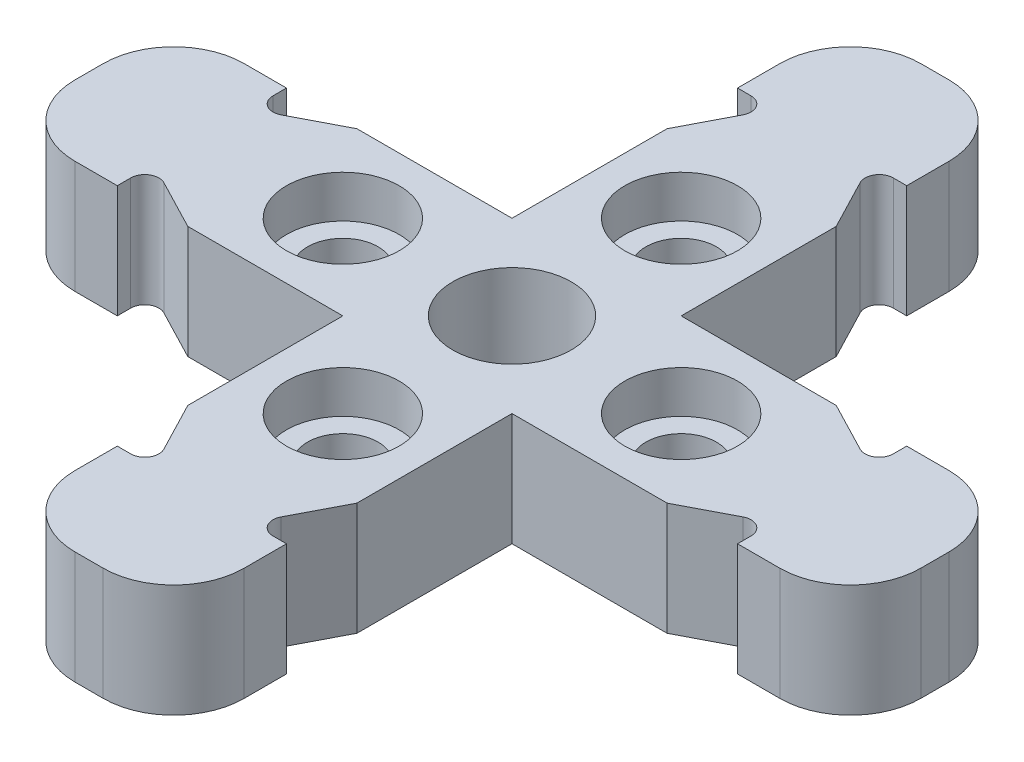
ISO-10303-21;
HEADER;
FILE_DESCRIPTION(('STEP AP214'),'2;1');
FILE_NAME('part.step','',(''),(''),'','','');
FILE_SCHEMA(('AUTOMOTIVE_DESIGN { 1 0 10303 214 1 1 1 1 }'));
ENDSEC;
DATA;
#1=APPLICATION_CONTEXT('core data for automotive mechanical design processes');
#2=APPLICATION_PROTOCOL_DEFINITION('international standard','automotive_design',2000,#1);
#3=PRODUCT_CONTEXT('',#1,'mechanical');
#4=PRODUCT('Part','Part','',(#3));
#5=PRODUCT_RELATED_PRODUCT_CATEGORY('part','',(#4));
#6=PRODUCT_DEFINITION_FORMATION('','',#4);
#7=PRODUCT_DEFINITION_CONTEXT('part definition',#1,'design');
#8=PRODUCT_DEFINITION('design','',#6,#7);
#9=PRODUCT_DEFINITION_SHAPE('','',#8);
#10=(LENGTH_UNIT() NAMED_UNIT(*) SI_UNIT(.MILLI.,.METRE.));
#11=(NAMED_UNIT(*) PLANE_ANGLE_UNIT() SI_UNIT($,.RADIAN.));
#12=(NAMED_UNIT(*) SI_UNIT($,.STERADIAN.) SOLID_ANGLE_UNIT());
#13=UNCERTAINTY_MEASURE_WITH_UNIT(LENGTH_MEASURE(1.E-05),#10,'distance_accuracy_value','');
#14=(GEOMETRIC_REPRESENTATION_CONTEXT(3) GLOBAL_UNCERTAINTY_ASSIGNED_CONTEXT((#13)) GLOBAL_UNIT_ASSIGNED_CONTEXT((#10,
#11,#12)) REPRESENTATION_CONTEXT('',''));
#15=CARTESIAN_POINT('',(0.,0.,0.));
#16=DIRECTION('',(0.,0.,1.));
#17=DIRECTION('',(1.,0.,0.));
#18=AXIS2_PLACEMENT_3D('',#15,#16,#17);
#19=CARTESIAN_POINT('',(-6.,0.,0.));
#20=DIRECTION('',(0.,1.,0.));
#21=DIRECTION('',(0.,0.,1.));
#22=AXIS2_PLACEMENT_3D('',#19,#20,#21);
#23=CYLINDRICAL_SURFACE('',#22,1.25);
#24=CARTESIAN_POINT('',(-6.,0.,0.));
#25=DIRECTION('',(0.,1.,0.));
#26=DIRECTION('',(0.,0.,1.));
#27=AXIS2_PLACEMENT_3D('',#24,#25,#26);
#28=CIRCLE('',#27,1.25);
#29=CARTESIAN_POINT('',(-6.,0.,1.25));
#30=VERTEX_POINT('',#29);
#31=EDGE_CURVE('E901',#30,#30,#28,.T.);
#32=ORIENTED_EDGE('',*,*,#31,.F.);
#33=EDGE_LOOP('',(#32));
#34=FACE_BOUND('',#33,.T.);
#35=CARTESIAN_POINT('',(-6.,2.5,0.));
#36=DIRECTION('',(0.,1.,0.));
#37=DIRECTION('',(0.,0.,1.));
#38=AXIS2_PLACEMENT_3D('',#35,#36,#37);
#39=CIRCLE('',#38,1.25);
#40=CARTESIAN_POINT('',(-6.,2.5,1.25));
#41=VERTEX_POINT('',#40);
#42=EDGE_CURVE('E51',#41,#41,#39,.F.);
#43=ORIENTED_EDGE('',*,*,#42,.F.);
#44=EDGE_LOOP('',(#43));
#45=FACE_BOUND('',#44,.T.);
#46=ADVANCED_FACE('F47',(#34,#45),#23,.F.);
#47=CARTESIAN_POINT('',(0.,0.,6.));
#48=DIRECTION('',(0.,1.,0.));
#49=DIRECTION('',(0.,0.,1.));
#50=AXIS2_PLACEMENT_3D('',#47,#48,#49);
#51=CYLINDRICAL_SURFACE('',#50,1.25);
#52=CARTESIAN_POINT('',(0.,0.,6.));
#53=DIRECTION('',(0.,1.,0.));
#54=DIRECTION('',(0.,0.,1.));
#55=AXIS2_PLACEMENT_3D('',#52,#53,#54);
#56=CIRCLE('',#55,1.25);
#57=CARTESIAN_POINT('',(0.,0.,7.25));
#58=VERTEX_POINT('',#57);
#59=EDGE_CURVE('E906',#58,#58,#56,.T.);
#60=ORIENTED_EDGE('',*,*,#59,.F.);
#61=EDGE_LOOP('',(#60));
#62=FACE_BOUND('',#61,.T.);
#63=CARTESIAN_POINT('',(0.,2.5,6.));
#64=DIRECTION('',(0.,1.,0.));
#65=DIRECTION('',(0.,0.,1.));
#66=AXIS2_PLACEMENT_3D('',#63,#64,#65);
#67=CIRCLE('',#66,1.25);
#68=CARTESIAN_POINT('',(0.,2.5,7.25));
#69=VERTEX_POINT('',#68);
#70=EDGE_CURVE('E894',#69,#69,#67,.F.);
#71=ORIENTED_EDGE('',*,*,#70,.F.);
#72=EDGE_LOOP('',(#71));
#73=FACE_BOUND('',#72,.T.);
#74=ADVANCED_FACE('F995',(#62,#73),#51,.F.);
#75=CARTESIAN_POINT('',(6.,0.,0.));
#76=DIRECTION('',(0.,1.,0.));
#77=DIRECTION('',(0.,0.,1.));
#78=AXIS2_PLACEMENT_3D('',#75,#76,#77);
#79=CYLINDRICAL_SURFACE('',#78,1.25);
#80=CARTESIAN_POINT('',(6.,0.,0.));
#81=DIRECTION('',(0.,1.,0.));
#82=DIRECTION('',(0.,0.,1.));
#83=AXIS2_PLACEMENT_3D('',#80,#81,#82);
#84=CIRCLE('',#83,1.25);
#85=CARTESIAN_POINT('',(6.,0.,1.25));
#86=VERTEX_POINT('',#85);
#87=EDGE_CURVE('E911',#86,#86,#84,.T.);
#88=ORIENTED_EDGE('',*,*,#87,.F.);
#89=EDGE_LOOP('',(#88));
#90=FACE_BOUND('',#89,.T.);
#91=CARTESIAN_POINT('',(6.,2.5,0.));
#92=DIRECTION('',(0.,1.,0.));
#93=DIRECTION('',(0.,0.,1.));
#94=AXIS2_PLACEMENT_3D('',#91,#92,#93);
#95=CIRCLE('',#94,1.25);
#96=CARTESIAN_POINT('',(6.,2.5,1.25));
#97=VERTEX_POINT('',#96);
#98=EDGE_CURVE('E890',#97,#97,#95,.F.);
#99=ORIENTED_EDGE('',*,*,#98,.F.);
#100=EDGE_LOOP('',(#99));
#101=FACE_BOUND('',#100,.T.);
#102=ADVANCED_FACE('F1002',(#90,#101),#79,.F.);
#103=CARTESIAN_POINT('',(0.,0.,-6.));
#104=DIRECTION('',(0.,1.,0.));
#105=DIRECTION('',(0.,0.,1.));
#106=AXIS2_PLACEMENT_3D('',#103,#104,#105);
#107=CYLINDRICAL_SURFACE('',#106,1.25);
#108=CARTESIAN_POINT('',(0.,0.,-6.));
#109=DIRECTION('',(0.,1.,0.));
#110=DIRECTION('',(0.,0.,1.));
#111=AXIS2_PLACEMENT_3D('',#108,#109,#110);
#112=CIRCLE('',#111,1.25);
#113=CARTESIAN_POINT('',(0.,0.,-4.75));
#114=VERTEX_POINT('',#113);
#115=EDGE_CURVE('E536',#114,#114,#112,.T.);
#116=ORIENTED_EDGE('',*,*,#115,.F.);
#117=EDGE_LOOP('',(#116));
#118=FACE_BOUND('',#117,.T.);
#119=CARTESIAN_POINT('',(0.,2.5,-6.));
#120=DIRECTION('',(0.,1.,0.));
#121=DIRECTION('',(0.,0.,1.));
#122=AXIS2_PLACEMENT_3D('',#119,#120,#121);
#123=CIRCLE('',#122,1.25);
#124=CARTESIAN_POINT('',(0.,2.5,-4.75));
#125=VERTEX_POINT('',#124);
#126=EDGE_CURVE('E886',#125,#125,#123,.F.);
#127=ORIENTED_EDGE('',*,*,#126,.F.);
#128=EDGE_LOOP('',(#127));
#129=FACE_BOUND('',#128,.T.);
#130=ADVANCED_FACE('F1157',(#118,#129),#107,.F.);
#131=CARTESIAN_POINT('',(2.52356011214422,4.,-10.5));
#132=DIRECTION('',(0.,-1.,0.));
#133=DIRECTION('',(0.,0.,-1.));
#134=AXIS2_PLACEMENT_3D('',#131,#132,#133);
#135=CYLINDRICAL_SURFACE('',#134,0.500000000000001);
#136=CARTESIAN_POINT('',(2.52356011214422,0.,-10.5));
#137=DIRECTION('',(0.,1.,0.));
#138=DIRECTION('',(0.,0.,1.));
#139=AXIS2_PLACEMENT_3D('',#136,#137,#138);
#140=CIRCLE('',#139,0.500000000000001);
#141=CARTESIAN_POINT('',(2.52356011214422,0.,-11.));
#142=VERTEX_POINT('',#141);
#143=CARTESIAN_POINT('',(2.07995171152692,0.,-10.269323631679));
#144=VERTEX_POINT('',#143);
#145=EDGE_CURVE('E387',#142,#144,#140,.T.);
#146=ORIENTED_EDGE('',*,*,#145,.F.);
#147=DIRECTION('',(0.,-1.,0.));
#148=VECTOR('',#147,1.);
#149=CARTESIAN_POINT('',(2.52356011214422,4.,-11.));
#150=LINE('',#149,#148);
#151=CARTESIAN_POINT('',(2.52356011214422,4.,-11.));
#152=VERTEX_POINT('',#151);
#153=EDGE_CURVE('E381',#152,#142,#150,.T.);
#154=ORIENTED_EDGE('',*,*,#153,.F.);
#155=CARTESIAN_POINT('',(2.52356011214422,4.,-10.5));
#156=DIRECTION('',(0.,1.,0.));
#157=DIRECTION('',(0.,0.,1.));
#158=AXIS2_PLACEMENT_3D('',#155,#156,#157);
#159=CIRCLE('',#158,0.500000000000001);
#160=CARTESIAN_POINT('',(2.07995171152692,4.,-10.269323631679));
#161=VERTEX_POINT('',#160);
#162=EDGE_CURVE('E384',#152,#161,#159,.T.);
#163=ORIENTED_EDGE('',*,*,#162,.T.);
#164=DIRECTION('',(0.,-1.,0.));
#165=VECTOR('',#164,1.);
#166=CARTESIAN_POINT('',(2.07995171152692,4.,-10.269323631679));
#167=LINE('',#166,#165);
#168=EDGE_CURVE('E532',#161,#144,#167,.T.);
#169=ORIENTED_EDGE('',*,*,#168,.T.);
#170=EDGE_LOOP('',(#146,#154,#163,#169));
#171=FACE_BOUND('',#170,.T.);
#172=ADVANCED_FACE('F383',(#171),#135,.F.);
#173=CARTESIAN_POINT('',(0.,4.,-11.));
#174=DIRECTION('',(0.,0.,1.));
#175=DIRECTION('',(1.,0.,0.));
#176=AXIS2_PLACEMENT_3D('',#173,#174,#175);
#177=PLANE('',#176);
#178=DIRECTION('',(-1.,0.,0.));
#179=VECTOR('',#178,1.);
#180=CARTESIAN_POINT('',(0.,0.,-11.));
#181=LINE('',#180,#179);
#182=CARTESIAN_POINT('',(3.00000000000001,0.,-11.));
#183=VERTEX_POINT('',#182);
#184=EDGE_CURVE('E535',#183,#142,#181,.T.);
#185=ORIENTED_EDGE('',*,*,#184,.F.);
#186=DIRECTION('',(0.,-1.,0.));
#187=VECTOR('',#186,1.);
#188=CARTESIAN_POINT('',(3.00000000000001,4.,-11.));
#189=LINE('',#188,#187);
#190=CARTESIAN_POINT('',(3.00000000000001,4.,-11.));
#191=VERTEX_POINT('',#190);
#192=EDGE_CURVE('E394',#191,#183,#189,.T.);
#193=ORIENTED_EDGE('',*,*,#192,.F.);
#194=DIRECTION('',(-1.,0.,0.));
#195=VECTOR('',#194,1.);
#196=CARTESIAN_POINT('',(0.,4.,-11.));
#197=LINE('',#196,#195);
#198=EDGE_CURVE('E400',#191,#152,#197,.T.);
#199=ORIENTED_EDGE('',*,*,#198,.T.);
#200=ORIENTED_EDGE('',*,*,#153,.T.);
#201=EDGE_LOOP('',(#185,#193,#199,#200));
#202=FACE_BOUND('',#201,.T.);
#203=ADVANCED_FACE('F406',(#202),#177,.T.);
#204=CARTESIAN_POINT('',(3.00000000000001,4.,0.));
#205=DIRECTION('',(-1.,0.,0.));
#206=DIRECTION('',(0.,0.,1.));
#207=AXIS2_PLACEMENT_3D('',#204,#205,#206);
#208=PLANE('',#207);
#209=DIRECTION('',(0.,0.,-1.));
#210=VECTOR('',#209,1.);
#211=CARTESIAN_POINT('',(3.00000000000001,0.,0.));
#212=LINE('',#211,#210);
#213=CARTESIAN_POINT('',(3.00000000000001,0.,-12.5));
#214=VERTEX_POINT('',#213);
#215=EDGE_CURVE('E539',#183,#214,#212,.T.);
#216=ORIENTED_EDGE('',*,*,#215,.T.);
#217=DIRECTION('',(0.,-1.,0.));
#218=VECTOR('',#217,1.);
#219=CARTESIAN_POINT('',(3.00000000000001,4.,-12.5));
#220=LINE('',#219,#218);
#221=CARTESIAN_POINT('',(3.00000000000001,4.,-12.5));
#222=VERTEX_POINT('',#221);
#223=EDGE_CURVE('E11',#214,#222,#220,.F.);
#224=ORIENTED_EDGE('',*,*,#223,.T.);
#225=DIRECTION('',(0.,0.,-1.));
#226=VECTOR('',#225,1.);
#227=CARTESIAN_POINT('',(3.00000000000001,4.,0.));
#228=LINE('',#227,#226);
#229=EDGE_CURVE('E409',#191,#222,#228,.T.);
#230=ORIENTED_EDGE('',*,*,#229,.F.);
#231=ORIENTED_EDGE('',*,*,#192,.T.);
#232=EDGE_LOOP('',(#216,#224,#230,#231));
#233=FACE_BOUND('',#232,.T.);
#234=ADVANCED_FACE('F1019',(#233),#208,.F.);
#235=CARTESIAN_POINT('',(0.,4.,-15.));
#236=DIRECTION('',(0.,0.,1.));
#237=DIRECTION('',(1.,0.,0.));
#238=AXIS2_PLACEMENT_3D('',#235,#236,#237);
#239=PLANE('',#238);
#240=DIRECTION('',(-1.,0.,0.));
#241=VECTOR('',#240,1.);
#242=CARTESIAN_POINT('',(0.,0.,-15.));
#243=LINE('',#242,#241);
#244=CARTESIAN_POINT('',(0.500000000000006,0.,-15.));
#245=VERTEX_POINT('',#244);
#246=CARTESIAN_POINT('',(-0.499999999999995,0.,-15.));
#247=VERTEX_POINT('',#246);
#248=EDGE_CURVE('E543',#245,#247,#243,.T.);
#249=ORIENTED_EDGE('',*,*,#248,.T.);
#250=DIRECTION('',(0.,-1.,0.));
#251=VECTOR('',#250,1.);
#252=CARTESIAN_POINT('',(-0.499999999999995,4.,-15.));
#253=LINE('',#252,#251);
#254=CARTESIAN_POINT('',(-0.499999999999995,4.,-15.));
#255=VERTEX_POINT('',#254);
#256=EDGE_CURVE('E57',#247,#255,#253,.F.);
#257=ORIENTED_EDGE('',*,*,#256,.T.);
#258=DIRECTION('',(-1.,0.,0.));
#259=VECTOR('',#258,1.);
#260=CARTESIAN_POINT('',(0.,4.,-15.));
#261=LINE('',#260,#259);
#262=CARTESIAN_POINT('',(0.500000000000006,4.,-15.));
#263=VERTEX_POINT('',#262);
#264=EDGE_CURVE('E412',#263,#255,#261,.T.);
#265=ORIENTED_EDGE('',*,*,#264,.F.);
#266=DIRECTION('',(0.,-1.,0.));
#267=VECTOR('',#266,1.);
#268=CARTESIAN_POINT('',(0.500000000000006,4.,-15.));
#269=LINE('',#268,#267);
#270=EDGE_CURVE('E880',#263,#245,#269,.T.);
#271=ORIENTED_EDGE('',*,*,#270,.T.);
#272=EDGE_LOOP('',(#249,#257,#265,#271));
#273=FACE_BOUND('',#272,.T.);
#274=ADVANCED_FACE('F1149',(#273),#239,.F.);
#275=CARTESIAN_POINT('',(-3.,4.,0.));
#276=DIRECTION('',(1.,0.,0.));
#277=DIRECTION('',(0.,0.,-1.));
#278=AXIS2_PLACEMENT_3D('',#275,#276,#277);
#279=PLANE('',#278);
#280=DIRECTION('',(0.,0.,1.));
#281=VECTOR('',#280,1.);
#282=CARTESIAN_POINT('',(-3.,4.,0.));
#283=LINE('',#282,#281);
#284=CARTESIAN_POINT('',(-2.99999999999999,4.,-12.5));
#285=VERTEX_POINT('',#284);
#286=CARTESIAN_POINT('',(-3.,4.,-11.));
#287=VERTEX_POINT('',#286);
#288=EDGE_CURVE('E420',#285,#287,#283,.T.);
#289=ORIENTED_EDGE('',*,*,#288,.F.);
#290=DIRECTION('',(0.,-1.,0.));
#291=VECTOR('',#290,1.);
#292=CARTESIAN_POINT('',(-2.99999999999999,4.,-12.5));
#293=LINE('',#292,#291);
#294=CARTESIAN_POINT('',(-2.99999999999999,0.,-12.5));
#295=VERTEX_POINT('',#294);
#296=EDGE_CURVE('E876',#285,#295,#293,.T.);
#297=ORIENTED_EDGE('',*,*,#296,.T.);
#298=DIRECTION('',(0.,0.,1.));
#299=VECTOR('',#298,1.);
#300=CARTESIAN_POINT('',(-3.,0.,0.));
#301=LINE('',#300,#299);
#302=CARTESIAN_POINT('',(-3.,0.,-11.));
#303=VERTEX_POINT('',#302);
#304=EDGE_CURVE('E548',#295,#303,#301,.T.);
#305=ORIENTED_EDGE('',*,*,#304,.T.);
#306=DIRECTION('',(0.,-1.,0.));
#307=VECTOR('',#306,1.);
#308=CARTESIAN_POINT('',(-3.,4.,-11.));
#309=LINE('',#308,#307);
#310=EDGE_CURVE('E783',#287,#303,#309,.T.);
#311=ORIENTED_EDGE('',*,*,#310,.F.);
#312=EDGE_LOOP('',(#289,#297,#305,#311));
#313=FACE_BOUND('',#312,.T.);
#314=ADVANCED_FACE('F1137',(#313),#279,.F.);
#315=CARTESIAN_POINT('',(0.,4.,-11.));
#316=DIRECTION('',(0.,0.,-1.));
#317=DIRECTION('',(-1.,0.,0.));
#318=AXIS2_PLACEMENT_3D('',#315,#316,#317);
#319=PLANE('',#318);
#320=DIRECTION('',(1.,0.,0.));
#321=VECTOR('',#320,1.);
#322=CARTESIAN_POINT('',(0.,0.,-11.));
#323=LINE('',#322,#321);
#324=CARTESIAN_POINT('',(-2.52356011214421,0.,-11.));
#325=VERTEX_POINT('',#324);
#326=EDGE_CURVE('E551',#303,#325,#323,.T.);
#327=ORIENTED_EDGE('',*,*,#326,.T.);
#328=DIRECTION('',(0.,-1.,0.));
#329=VECTOR('',#328,1.);
#330=CARTESIAN_POINT('',(-2.52356011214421,4.,-11.));
#331=LINE('',#330,#329);
#332=CARTESIAN_POINT('',(-2.52356011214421,4.,-11.));
#333=VERTEX_POINT('',#332);
#334=EDGE_CURVE('E779',#333,#325,#331,.T.);
#335=ORIENTED_EDGE('',*,*,#334,.F.);
#336=DIRECTION('',(1.,0.,0.));
#337=VECTOR('',#336,1.);
#338=CARTESIAN_POINT('',(0.,4.,-11.));
#339=LINE('',#338,#337);
#340=EDGE_CURVE('E423',#287,#333,#339,.T.);
#341=ORIENTED_EDGE('',*,*,#340,.F.);
#342=ORIENTED_EDGE('',*,*,#310,.T.);
#343=EDGE_LOOP('',(#327,#335,#341,#342));
#344=FACE_BOUND('',#343,.T.);
#345=ADVANCED_FACE('F1144',(#344),#319,.F.);
#346=CARTESIAN_POINT('',(-2.52356011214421,4.,-10.5));
#347=DIRECTION('',(0.,-1.,0.));
#348=DIRECTION('',(0.,0.,-1.));
#349=AXIS2_PLACEMENT_3D('',#346,#347,#348);
#350=CYLINDRICAL_SURFACE('',#349,0.500000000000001);
#351=CARTESIAN_POINT('',(-2.52356011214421,0.,-10.5));
#352=DIRECTION('',(0.,1.,0.));
#353=DIRECTION('',(0.,0.,1.));
#354=AXIS2_PLACEMENT_3D('',#351,#352,#353);
#355=CIRCLE('',#354,0.500000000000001);
#356=CARTESIAN_POINT('',(-2.07995171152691,0.,-10.269323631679));
#357=VERTEX_POINT('',#356);
#358=EDGE_CURVE('E555',#325,#357,#355,.F.);
#359=ORIENTED_EDGE('',*,*,#358,.T.);
#360=DIRECTION('',(0.,-1.,0.));
#361=VECTOR('',#360,1.);
#362=CARTESIAN_POINT('',(-2.07995171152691,4.,-10.269323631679));
#363=LINE('',#362,#361);
#364=CARTESIAN_POINT('',(-2.07995171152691,4.,-10.269323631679));
#365=VERTEX_POINT('',#364);
#366=EDGE_CURVE('E775',#365,#357,#363,.T.);
#367=ORIENTED_EDGE('',*,*,#366,.F.);
#368=CARTESIAN_POINT('',(-2.52356011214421,4.,-10.5));
#369=DIRECTION('',(0.,1.,0.));
#370=DIRECTION('',(0.,0.,1.));
#371=AXIS2_PLACEMENT_3D('',#368,#369,#370);
#372=CIRCLE('',#371,0.500000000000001);
#373=EDGE_CURVE('E427',#333,#365,#372,.F.);
#374=ORIENTED_EDGE('',*,*,#373,.F.);
#375=ORIENTED_EDGE('',*,*,#334,.T.);
#376=EDGE_LOOP('',(#359,#367,#374,#375));
#377=FACE_BOUND('',#376,.T.);
#378=ADVANCED_FACE('F1140',(#377),#350,.F.);
#379=CARTESIAN_POINT('',(-5.84068010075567,4.,-3.03715365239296));
#380=DIRECTION('',(0.887216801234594,0.,0.461352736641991));
#381=DIRECTION('',(0.461352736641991,0.,-0.887216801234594));
#382=AXIS2_PLACEMENT_3D('',#379,#380,#381);
#383=PLANE('',#382);
#384=DIRECTION('',(-0.461352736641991,0.,0.887216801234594));
#385=VECTOR('',#384,1.);
#386=CARTESIAN_POINT('',(-5.84068010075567,0.,-3.03715365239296));
#387=LINE('',#386,#385);
#388=CARTESIAN_POINT('',(-3.,0.,-8.5));
#389=VERTEX_POINT('',#388);
#390=EDGE_CURVE('E558',#357,#389,#387,.T.);
#391=ORIENTED_EDGE('',*,*,#390,.T.);
#392=DIRECTION('',(0.,-1.,0.));
#393=VECTOR('',#392,1.);
#394=CARTESIAN_POINT('',(-3.,4.,-8.5));
#395=LINE('',#394,#393);
#396=CARTESIAN_POINT('',(-3.,4.,-8.5));
#397=VERTEX_POINT('',#396);
#398=EDGE_CURVE('E771',#397,#389,#395,.T.);
#399=ORIENTED_EDGE('',*,*,#398,.F.);
#400=DIRECTION('',(-0.461352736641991,0.,0.887216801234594));
#401=VECTOR('',#400,1.);
#402=CARTESIAN_POINT('',(-5.84068010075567,4.,-3.03715365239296));
#403=LINE('',#402,#401);
#404=EDGE_CURVE('E430',#365,#397,#403,.T.);
#405=ORIENTED_EDGE('',*,*,#404,.F.);
#406=ORIENTED_EDGE('',*,*,#366,.T.);
#407=EDGE_LOOP('',(#391,#399,#405,#406));
#408=FACE_BOUND('',#407,.T.);
#409=ADVANCED_FACE('F1135',(#408),#383,.F.);
#410=CARTESIAN_POINT('',(-3.,0.,-3.));
#411=VERTEX_POINT('',#410);
#412=EDGE_CURVE('E552',#389,#411,#301,.T.);
#413=ORIENTED_EDGE('',*,*,#412,.T.);
#414=DIRECTION('',(0.,-1.,0.));
#415=VECTOR('',#414,1.);
#416=CARTESIAN_POINT('',(-3.,4.,-3.));
#417=LINE('',#416,#415);
#418=CARTESIAN_POINT('',(-3.,4.,-3.));
#419=VERTEX_POINT('',#418);
#420=EDGE_CURVE('E767',#419,#411,#417,.T.);
#421=ORIENTED_EDGE('',*,*,#420,.F.);
#422=EDGE_CURVE('E424',#397,#419,#283,.T.);
#423=ORIENTED_EDGE('',*,*,#422,.F.);
#424=ORIENTED_EDGE('',*,*,#398,.T.);
#425=EDGE_LOOP('',(#413,#421,#423,#424));
#426=FACE_BOUND('',#425,.T.);
#427=ADVANCED_FACE('F1132',(#426),#279,.F.);
#428=CARTESIAN_POINT('',(0.,4.,-3.));
#429=DIRECTION('',(0.,0.,1.));
#430=DIRECTION('',(1.,0.,0.));
#431=AXIS2_PLACEMENT_3D('',#428,#429,#430);
#432=PLANE('',#431);
#433=DIRECTION('',(-1.,0.,0.));
#434=VECTOR('',#433,1.);
#435=CARTESIAN_POINT('',(0.,0.,-3.));
#436=LINE('',#435,#434);
#437=CARTESIAN_POINT('',(-8.49999999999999,0.,-3.));
#438=VERTEX_POINT('',#437);
#439=EDGE_CURVE('E561',#411,#438,#436,.T.);
#440=ORIENTED_EDGE('',*,*,#439,.T.);
#441=DIRECTION('',(0.,-1.,0.));
#442=VECTOR('',#441,1.);
#443=CARTESIAN_POINT('',(-8.49999999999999,4.,-3.));
#444=LINE('',#443,#442);
#445=CARTESIAN_POINT('',(-8.49999999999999,4.,-3.));
#446=VERTEX_POINT('',#445);
#447=EDGE_CURVE('E764',#446,#438,#444,.T.);
#448=ORIENTED_EDGE('',*,*,#447,.F.);
#449=DIRECTION('',(-1.,0.,0.));
#450=VECTOR('',#449,1.);
#451=CARTESIAN_POINT('',(0.,4.,-3.));
#452=LINE('',#451,#450);
#453=EDGE_CURVE('E433',#419,#446,#452,.T.);
#454=ORIENTED_EDGE('',*,*,#453,.F.);
#455=ORIENTED_EDGE('',*,*,#420,.T.);
#456=EDGE_LOOP('',(#440,#448,#454,#455));
#457=FACE_BOUND('',#456,.T.);
#458=ADVANCED_FACE('F1120',(#457),#432,.F.);
#459=CARTESIAN_POINT('',(-3.03715365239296,4.,-5.84068010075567));
#460=DIRECTION('',(-0.461352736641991,0.,-0.887216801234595));
#461=DIRECTION('',(-0.887216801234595,0.,0.461352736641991));
#462=AXIS2_PLACEMENT_3D('',#459,#460,#461);
#463=PLANE('',#462);
#464=DIRECTION('',(0.887216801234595,0.,-0.461352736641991));
#465=VECTOR('',#464,1.);
#466=CARTESIAN_POINT('',(-3.03715365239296,0.,-5.84068010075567));
#467=LINE('',#466,#465);
#468=CARTESIAN_POINT('',(-10.269323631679,0.,-2.07995171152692));
#469=VERTEX_POINT('',#468);
#470=EDGE_CURVE('E565',#469,#438,#467,.T.);
#471=ORIENTED_EDGE('',*,*,#470,.F.);
#472=DIRECTION('',(0.,-1.,0.));
#473=VECTOR('',#472,1.);
#474=CARTESIAN_POINT('',(-10.269323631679,4.,-2.07995171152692));
#475=LINE('',#474,#473);
#476=CARTESIAN_POINT('',(-10.269323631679,4.,-2.07995171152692));
#477=VERTEX_POINT('',#476);
#478=EDGE_CURVE('E761',#477,#469,#475,.T.);
#479=ORIENTED_EDGE('',*,*,#478,.F.);
#480=DIRECTION('',(0.887216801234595,0.,-0.461352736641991));
#481=VECTOR('',#480,1.);
#482=CARTESIAN_POINT('',(-3.03715365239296,4.,-5.84068010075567));
#483=LINE('',#482,#481);
#484=EDGE_CURVE('E436',#477,#446,#483,.T.);
#485=ORIENTED_EDGE('',*,*,#484,.T.);
#486=ORIENTED_EDGE('',*,*,#447,.T.);
#487=EDGE_LOOP('',(#471,#479,#485,#486));
#488=FACE_BOUND('',#487,.T.);
#489=ADVANCED_FACE('F1127',(#488),#463,.T.);
#490=CARTESIAN_POINT('',(-10.5,4.,-2.52356011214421));
#491=DIRECTION('',(0.,-1.,0.));
#492=DIRECTION('',(0.,0.,-1.));
#493=AXIS2_PLACEMENT_3D('',#490,#491,#492);
#494=CYLINDRICAL_SURFACE('',#493,0.500000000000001);
#495=CARTESIAN_POINT('',(-10.5,0.,-2.52356011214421));
#496=DIRECTION('',(0.,1.,0.));
#497=DIRECTION('',(0.,0.,1.));
#498=AXIS2_PLACEMENT_3D('',#495,#496,#497);
#499=CIRCLE('',#498,0.500000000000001);
#500=CARTESIAN_POINT('',(-11.,0.,-2.52356011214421));
#501=VERTEX_POINT('',#500);
#502=EDGE_CURVE('E570',#501,#469,#499,.T.);
#503=ORIENTED_EDGE('',*,*,#502,.F.);
#504=DIRECTION('',(0.,-1.,0.));
#505=VECTOR('',#504,1.);
#506=CARTESIAN_POINT('',(-11.,4.,-2.52356011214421));
#507=LINE('',#506,#505);
#508=CARTESIAN_POINT('',(-11.,4.,-2.52356011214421));
#509=VERTEX_POINT('',#508);
#510=EDGE_CURVE('E758',#509,#501,#507,.T.);
#511=ORIENTED_EDGE('',*,*,#510,.F.);
#512=CARTESIAN_POINT('',(-10.5,4.,-2.52356011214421));
#513=DIRECTION('',(0.,1.,0.));
#514=DIRECTION('',(0.,0.,1.));
#515=AXIS2_PLACEMENT_3D('',#512,#513,#514);
#516=CIRCLE('',#515,0.500000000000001);
#517=EDGE_CURVE('E441',#509,#477,#516,.T.);
#518=ORIENTED_EDGE('',*,*,#517,.T.);
#519=ORIENTED_EDGE('',*,*,#478,.T.);
#520=EDGE_LOOP('',(#503,#511,#518,#519));
#521=FACE_BOUND('',#520,.T.);
#522=ADVANCED_FACE('F1123',(#521),#494,.F.);
#523=CARTESIAN_POINT('',(-11.,4.,0.));
#524=DIRECTION('',(1.,0.,0.));
#525=DIRECTION('',(0.,0.,-1.));
#526=AXIS2_PLACEMENT_3D('',#523,#524,#525);
#527=PLANE('',#526);
#528=DIRECTION('',(0.,0.,1.));
#529=VECTOR('',#528,1.);
#530=CARTESIAN_POINT('',(-11.,0.,0.));
#531=LINE('',#530,#529);
#532=CARTESIAN_POINT('',(-11.,0.,-3.));
#533=VERTEX_POINT('',#532);
#534=EDGE_CURVE('E574',#533,#501,#531,.T.);
#535=ORIENTED_EDGE('',*,*,#534,.F.);
#536=DIRECTION('',(0.,-1.,0.));
#537=VECTOR('',#536,1.);
#538=CARTESIAN_POINT('',(-11.,4.,-3.));
#539=LINE('',#538,#537);
#540=CARTESIAN_POINT('',(-11.,4.,-3.));
#541=VERTEX_POINT('',#540);
#542=EDGE_CURVE('E755',#541,#533,#539,.T.);
#543=ORIENTED_EDGE('',*,*,#542,.F.);
#544=DIRECTION('',(0.,0.,1.));
#545=VECTOR('',#544,1.);
#546=CARTESIAN_POINT('',(-11.,4.,0.));
#547=LINE('',#546,#545);
#548=EDGE_CURVE('E445',#541,#509,#547,.T.);
#549=ORIENTED_EDGE('',*,*,#548,.T.);
#550=ORIENTED_EDGE('',*,*,#510,.T.);
#551=EDGE_LOOP('',(#535,#543,#549,#550));
#552=FACE_BOUND('',#551,.T.);
#553=ADVANCED_FACE('F1118',(#552),#527,.T.);
#554=CARTESIAN_POINT('',(-12.5,0.,-3.));
#555=VERTEX_POINT('',#554);
#556=EDGE_CURVE('E566',#533,#555,#436,.T.);
#557=ORIENTED_EDGE('',*,*,#556,.T.);
#558=DIRECTION('',(0.,-1.,0.));
#559=VECTOR('',#558,1.);
#560=CARTESIAN_POINT('',(-12.5,4.,-3.));
#561=LINE('',#560,#559);
#562=CARTESIAN_POINT('',(-12.5,4.,-3.));
#563=VERTEX_POINT('',#562);
#564=EDGE_CURVE('E873',#555,#563,#561,.F.);
#565=ORIENTED_EDGE('',*,*,#564,.T.);
#566=EDGE_CURVE('E437',#541,#563,#452,.T.);
#567=ORIENTED_EDGE('',*,*,#566,.F.);
#568=ORIENTED_EDGE('',*,*,#542,.T.);
#569=EDGE_LOOP('',(#557,#565,#567,#568));
#570=FACE_BOUND('',#569,.T.);
#571=ADVANCED_FACE('F1114',(#570),#432,.F.);
#572=CARTESIAN_POINT('',(-15.,4.,0.));
#573=DIRECTION('',(1.,0.,0.));
#574=DIRECTION('',(0.,0.,-1.));
#575=AXIS2_PLACEMENT_3D('',#572,#573,#574);
#576=PLANE('',#575);
#577=DIRECTION('',(0.,0.,1.));
#578=VECTOR('',#577,1.);
#579=CARTESIAN_POINT('',(-15.,0.,0.));
#580=LINE('',#579,#578);
#581=CARTESIAN_POINT('',(-15.,0.,-0.5));
#582=VERTEX_POINT('',#581);
#583=CARTESIAN_POINT('',(-15.,0.,0.5));
#584=VERTEX_POINT('',#583);
#585=EDGE_CURVE('E578',#582,#584,#580,.T.);
#586=ORIENTED_EDGE('',*,*,#585,.T.);
#587=DIRECTION('',(0.,-1.,0.));
#588=VECTOR('',#587,1.);
#589=CARTESIAN_POINT('',(-15.,4.,0.5));
#590=LINE('',#589,#588);
#591=CARTESIAN_POINT('',(-15.,4.,0.5));
#592=VERTEX_POINT('',#591);
#593=EDGE_CURVE('E870',#584,#592,#590,.F.);
#594=ORIENTED_EDGE('',*,*,#593,.T.);
#595=DIRECTION('',(0.,0.,1.));
#596=VECTOR('',#595,1.);
#597=CARTESIAN_POINT('',(-15.,4.,0.));
#598=LINE('',#597,#596);
#599=CARTESIAN_POINT('',(-15.,4.,-0.5));
#600=VERTEX_POINT('',#599);
#601=EDGE_CURVE('E449',#600,#592,#598,.T.);
#602=ORIENTED_EDGE('',*,*,#601,.F.);
#603=DIRECTION('',(0.,-1.,0.));
#604=VECTOR('',#603,1.);
#605=CARTESIAN_POINT('',(-15.,4.,-0.5));
#606=LINE('',#605,#604);
#607=EDGE_CURVE('E866',#600,#582,#606,.T.);
#608=ORIENTED_EDGE('',*,*,#607,.T.);
#609=EDGE_LOOP('',(#586,#594,#602,#608));
#610=FACE_BOUND('',#609,.T.);
#611=ADVANCED_FACE('F1111',(#610),#576,.F.);
#612=CARTESIAN_POINT('',(0.,4.,3.));
#613=DIRECTION('',(0.,0.,-1.));
#614=DIRECTION('',(-1.,0.,0.));
#615=AXIS2_PLACEMENT_3D('',#612,#613,#614);
#616=PLANE('',#615);
#617=DIRECTION('',(1.,0.,0.));
#618=VECTOR('',#617,1.);
#619=CARTESIAN_POINT('',(0.,4.,3.));
#620=LINE('',#619,#618);
#621=CARTESIAN_POINT('',(-12.5,4.,3.));
#622=VERTEX_POINT('',#621);
#623=CARTESIAN_POINT('',(-11.,4.,3.));
#624=VERTEX_POINT('',#623);
#625=EDGE_CURVE('E453',#622,#624,#620,.T.);
#626=ORIENTED_EDGE('',*,*,#625,.F.);
#627=DIRECTION('',(0.,-1.,0.));
#628=VECTOR('',#627,1.);
#629=CARTESIAN_POINT('',(-12.5,4.,3.));
#630=LINE('',#629,#628);
#631=CARTESIAN_POINT('',(-12.5,0.,3.));
#632=VERTEX_POINT('',#631);
#633=EDGE_CURVE('E862',#622,#632,#630,.T.);
#634=ORIENTED_EDGE('',*,*,#633,.T.);
#635=DIRECTION('',(1.,0.,0.));
#636=VECTOR('',#635,1.);
#637=CARTESIAN_POINT('',(0.,0.,3.));
#638=LINE('',#637,#636);
#639=CARTESIAN_POINT('',(-11.,0.,3.));
#640=VERTEX_POINT('',#639);
#641=EDGE_CURVE('E582',#632,#640,#638,.T.);
#642=ORIENTED_EDGE('',*,*,#641,.T.);
#643=DIRECTION('',(0.,-1.,0.));
#644=VECTOR('',#643,1.);
#645=CARTESIAN_POINT('',(-11.,4.,3.));
#646=LINE('',#645,#644);
#647=EDGE_CURVE('E751',#624,#640,#646,.T.);
#648=ORIENTED_EDGE('',*,*,#647,.F.);
#649=EDGE_LOOP('',(#626,#634,#642,#648));
#650=FACE_BOUND('',#649,.T.);
#651=ADVANCED_FACE('F1099',(#650),#616,.F.);
#652=CARTESIAN_POINT('',(-11.,4.,0.));
#653=DIRECTION('',(-1.,0.,0.));
#654=DIRECTION('',(0.,0.,1.));
#655=AXIS2_PLACEMENT_3D('',#652,#653,#654);
#656=PLANE('',#655);
#657=DIRECTION('',(0.,0.,-1.));
#658=VECTOR('',#657,1.);
#659=CARTESIAN_POINT('',(-11.,0.,0.));
#660=LINE('',#659,#658);
#661=CARTESIAN_POINT('',(-11.,0.,2.52356011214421));
#662=VERTEX_POINT('',#661);
#663=EDGE_CURVE('E585',#640,#662,#660,.T.);
#664=ORIENTED_EDGE('',*,*,#663,.T.);
#665=DIRECTION('',(0.,-1.,0.));
#666=VECTOR('',#665,1.);
#667=CARTESIAN_POINT('',(-11.,4.,2.52356011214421));
#668=LINE('',#667,#666);
#669=CARTESIAN_POINT('',(-11.,4.,2.52356011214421));
#670=VERTEX_POINT('',#669);
#671=EDGE_CURVE('E747',#670,#662,#668,.T.);
#672=ORIENTED_EDGE('',*,*,#671,.F.);
#673=DIRECTION('',(0.,0.,-1.));
#674=VECTOR('',#673,1.);
#675=CARTESIAN_POINT('',(-11.,4.,0.));
#676=LINE('',#675,#674);
#677=EDGE_CURVE('E456',#624,#670,#676,.T.);
#678=ORIENTED_EDGE('',*,*,#677,.F.);
#679=ORIENTED_EDGE('',*,*,#647,.T.);
#680=EDGE_LOOP('',(#664,#672,#678,#679));
#681=FACE_BOUND('',#680,.T.);
#682=ADVANCED_FACE('F1106',(#681),#656,.F.);
#683=CARTESIAN_POINT('',(-10.5,4.,2.52356011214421));
#684=DIRECTION('',(0.,-1.,0.));
#685=DIRECTION('',(0.,0.,-1.));
#686=AXIS2_PLACEMENT_3D('',#683,#684,#685);
#687=CYLINDRICAL_SURFACE('',#686,0.500000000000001);
#688=CARTESIAN_POINT('',(-10.5,0.,2.52356011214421));
#689=DIRECTION('',(0.,1.,0.));
#690=DIRECTION('',(0.,0.,1.));
#691=AXIS2_PLACEMENT_3D('',#688,#689,#690);
#692=CIRCLE('',#691,0.500000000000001);
#693=CARTESIAN_POINT('',(-10.269323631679,0.,2.07995171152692));
#694=VERTEX_POINT('',#693);
#695=EDGE_CURVE('E589',#662,#694,#692,.F.);
#696=ORIENTED_EDGE('',*,*,#695,.T.);
#697=DIRECTION('',(0.,-1.,0.));
#698=VECTOR('',#697,1.);
#699=CARTESIAN_POINT('',(-10.269323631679,4.,2.07995171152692));
#700=LINE('',#699,#698);
#701=CARTESIAN_POINT('',(-10.269323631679,4.,2.07995171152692));
#702=VERTEX_POINT('',#701);
#703=EDGE_CURVE('E743',#702,#694,#700,.T.);
#704=ORIENTED_EDGE('',*,*,#703,.F.);
#705=CARTESIAN_POINT('',(-10.5,4.,2.52356011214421));
#706=DIRECTION('',(0.,1.,0.));
#707=DIRECTION('',(0.,0.,1.));
#708=AXIS2_PLACEMENT_3D('',#705,#706,#707);
#709=CIRCLE('',#708,0.500000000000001);
#710=EDGE_CURVE('E460',#670,#702,#709,.F.);
#711=ORIENTED_EDGE('',*,*,#710,.F.);
#712=ORIENTED_EDGE('',*,*,#671,.T.);
#713=EDGE_LOOP('',(#696,#704,#711,#712));
#714=FACE_BOUND('',#713,.T.);
#715=ADVANCED_FACE('F1102',(#714),#687,.F.);
#716=CARTESIAN_POINT('',(-3.03715365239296,4.,5.84068010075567));
#717=DIRECTION('',(0.461352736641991,0.,-0.887216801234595));
#718=DIRECTION('',(-0.887216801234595,0.,-0.461352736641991));
#719=AXIS2_PLACEMENT_3D('',#716,#717,#718);
#720=PLANE('',#719);
#721=DIRECTION('',(0.887216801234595,0.,0.461352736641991));
#722=VECTOR('',#721,1.);
#723=CARTESIAN_POINT('',(-3.03715365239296,0.,5.84068010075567));
#724=LINE('',#723,#722);
#725=CARTESIAN_POINT('',(-8.5,0.,3.));
#726=VERTEX_POINT('',#725);
#727=EDGE_CURVE('E592',#694,#726,#724,.T.);
#728=ORIENTED_EDGE('',*,*,#727,.T.);
#729=DIRECTION('',(0.,-1.,0.));
#730=VECTOR('',#729,1.);
#731=CARTESIAN_POINT('',(-8.5,4.,3.));
#732=LINE('',#731,#730);
#733=CARTESIAN_POINT('',(-8.5,4.,3.));
#734=VERTEX_POINT('',#733);
#735=EDGE_CURVE('E739',#734,#726,#732,.T.);
#736=ORIENTED_EDGE('',*,*,#735,.F.);
#737=DIRECTION('',(0.887216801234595,0.,0.461352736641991));
#738=VECTOR('',#737,1.);
#739=CARTESIAN_POINT('',(-3.03715365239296,4.,5.84068010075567));
#740=LINE('',#739,#738);
#741=EDGE_CURVE('E463',#702,#734,#740,.T.);
#742=ORIENTED_EDGE('',*,*,#741,.F.);
#743=ORIENTED_EDGE('',*,*,#703,.T.);
#744=EDGE_LOOP('',(#728,#736,#742,#743));
#745=FACE_BOUND('',#744,.T.);
#746=ADVANCED_FACE('F1097',(#745),#720,.F.);
#747=CARTESIAN_POINT('',(-3.,0.,3.));
#748=VERTEX_POINT('',#747);
#749=EDGE_CURVE('E586',#726,#748,#638,.T.);
#750=ORIENTED_EDGE('',*,*,#749,.T.);
#751=DIRECTION('',(0.,-1.,0.));
#752=VECTOR('',#751,1.);
#753=CARTESIAN_POINT('',(-3.,4.,3.));
#754=LINE('',#753,#752);
#755=CARTESIAN_POINT('',(-3.,4.,3.));
#756=VERTEX_POINT('',#755);
#757=EDGE_CURVE('E735',#756,#748,#754,.T.);
#758=ORIENTED_EDGE('',*,*,#757,.F.);
#759=EDGE_CURVE('E457',#734,#756,#620,.T.);
#760=ORIENTED_EDGE('',*,*,#759,.F.);
#761=ORIENTED_EDGE('',*,*,#735,.T.);
#762=EDGE_LOOP('',(#750,#758,#760,#761));
#763=FACE_BOUND('',#762,.T.);
#764=ADVANCED_FACE('F1094',(#763),#616,.F.);
#765=CARTESIAN_POINT('',(-3.,4.,0.));
#766=DIRECTION('',(1.,0.,0.));
#767=DIRECTION('',(0.,0.,-1.));
#768=AXIS2_PLACEMENT_3D('',#765,#766,#767);
#769=PLANE('',#768);
#770=DIRECTION('',(0.,0.,1.));
#771=VECTOR('',#770,1.);
#772=CARTESIAN_POINT('',(-3.,0.,0.));
#773=LINE('',#772,#771);
#774=CARTESIAN_POINT('',(-3.,0.,8.5));
#775=VERTEX_POINT('',#774);
#776=EDGE_CURVE('E595',#748,#775,#773,.T.);
#777=ORIENTED_EDGE('',*,*,#776,.T.);
#778=DIRECTION('',(0.,-1.,0.));
#779=VECTOR('',#778,1.);
#780=CARTESIAN_POINT('',(-3.,4.,8.5));
#781=LINE('',#780,#779);
#782=CARTESIAN_POINT('',(-3.,4.,8.5));
#783=VERTEX_POINT('',#782);
#784=EDGE_CURVE('E732',#783,#775,#781,.T.);
#785=ORIENTED_EDGE('',*,*,#784,.F.);
#786=DIRECTION('',(0.,0.,1.));
#787=VECTOR('',#786,1.);
#788=CARTESIAN_POINT('',(-3.,4.,0.));
#789=LINE('',#788,#787);
#790=EDGE_CURVE('E466',#756,#783,#789,.T.);
#791=ORIENTED_EDGE('',*,*,#790,.F.);
#792=ORIENTED_EDGE('',*,*,#757,.T.);
#793=EDGE_LOOP('',(#777,#785,#791,#792));
#794=FACE_BOUND('',#793,.T.);
#795=ADVANCED_FACE('F1082',(#794),#769,.F.);
#796=CARTESIAN_POINT('',(-5.84068010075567,4.,3.03715365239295));
#797=DIRECTION('',(-0.887216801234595,0.,0.46135273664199));
#798=DIRECTION('',(0.46135273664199,0.,0.887216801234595));
#799=AXIS2_PLACEMENT_3D('',#796,#797,#798);
#800=PLANE('',#799);
#801=DIRECTION('',(-0.46135273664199,0.,-0.887216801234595));
#802=VECTOR('',#801,1.);
#803=CARTESIAN_POINT('',(-5.84068010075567,0.,3.03715365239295));
#804=LINE('',#803,#802);
#805=CARTESIAN_POINT('',(-2.07995171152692,0.,10.269323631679));
#806=VERTEX_POINT('',#805);
#807=EDGE_CURVE('E599',#806,#775,#804,.T.);
#808=ORIENTED_EDGE('',*,*,#807,.F.);
#809=DIRECTION('',(0.,-1.,0.));
#810=VECTOR('',#809,1.);
#811=CARTESIAN_POINT('',(-2.07995171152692,4.,10.269323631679));
#812=LINE('',#811,#810);
#813=CARTESIAN_POINT('',(-2.07995171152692,4.,10.269323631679));
#814=VERTEX_POINT('',#813);
#815=EDGE_CURVE('E729',#814,#806,#812,.T.);
#816=ORIENTED_EDGE('',*,*,#815,.F.);
#817=DIRECTION('',(-0.46135273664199,0.,-0.887216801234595));
#818=VECTOR('',#817,1.);
#819=CARTESIAN_POINT('',(-5.84068010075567,4.,3.03715365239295));
#820=LINE('',#819,#818);
#821=EDGE_CURVE('E469',#814,#783,#820,.T.);
#822=ORIENTED_EDGE('',*,*,#821,.T.);
#823=ORIENTED_EDGE('',*,*,#784,.T.);
#824=EDGE_LOOP('',(#808,#816,#822,#823));
#825=FACE_BOUND('',#824,.T.);
#826=ADVANCED_FACE('F1089',(#825),#800,.T.);
#827=CARTESIAN_POINT('',(-2.52356011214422,4.,10.5));
#828=DIRECTION('',(0.,-1.,0.));
#829=DIRECTION('',(0.,0.,-1.));
#830=AXIS2_PLACEMENT_3D('',#827,#828,#829);
#831=CYLINDRICAL_SURFACE('',#830,0.500000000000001);
#832=CARTESIAN_POINT('',(-2.52356011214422,0.,10.5));
#833=DIRECTION('',(0.,1.,0.));
#834=DIRECTION('',(0.,0.,1.));
#835=AXIS2_PLACEMENT_3D('',#832,#833,#834);
#836=CIRCLE('',#835,0.500000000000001);
#837=CARTESIAN_POINT('',(-2.52356011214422,0.,11.));
#838=VERTEX_POINT('',#837);
#839=EDGE_CURVE('E604',#838,#806,#836,.T.);
#840=ORIENTED_EDGE('',*,*,#839,.F.);
#841=DIRECTION('',(0.,-1.,0.));
#842=VECTOR('',#841,1.);
#843=CARTESIAN_POINT('',(-2.52356011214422,4.,11.));
#844=LINE('',#843,#842);
#845=CARTESIAN_POINT('',(-2.52356011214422,4.,11.));
#846=VERTEX_POINT('',#845);
#847=EDGE_CURVE('E726',#846,#838,#844,.T.);
#848=ORIENTED_EDGE('',*,*,#847,.F.);
#849=CARTESIAN_POINT('',(-2.52356011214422,4.,10.5));
#850=DIRECTION('',(0.,1.,0.));
#851=DIRECTION('',(0.,0.,1.));
#852=AXIS2_PLACEMENT_3D('',#849,#850,#851);
#853=CIRCLE('',#852,0.500000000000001);
#854=EDGE_CURVE('E474',#846,#814,#853,.T.);
#855=ORIENTED_EDGE('',*,*,#854,.T.);
#856=ORIENTED_EDGE('',*,*,#815,.T.);
#857=EDGE_LOOP('',(#840,#848,#855,#856));
#858=FACE_BOUND('',#857,.T.);
#859=ADVANCED_FACE('F1085',(#858),#831,.F.);
#860=CARTESIAN_POINT('',(0.,4.,11.));
#861=DIRECTION('',(0.,0.,-1.));
#862=DIRECTION('',(-1.,0.,0.));
#863=AXIS2_PLACEMENT_3D('',#860,#861,#862);
#864=PLANE('',#863);
#865=DIRECTION('',(1.,0.,0.));
#866=VECTOR('',#865,1.);
#867=CARTESIAN_POINT('',(0.,0.,11.));
#868=LINE('',#867,#866);
#869=CARTESIAN_POINT('',(-2.99999999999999,0.,11.));
#870=VERTEX_POINT('',#869);
#871=EDGE_CURVE('E608',#870,#838,#868,.T.);
#872=ORIENTED_EDGE('',*,*,#871,.F.);
#873=DIRECTION('',(0.,-1.,0.));
#874=VECTOR('',#873,1.);
#875=CARTESIAN_POINT('',(-2.99999999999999,4.,11.));
#876=LINE('',#875,#874);
#877=CARTESIAN_POINT('',(-2.99999999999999,4.,11.));
#878=VERTEX_POINT('',#877);
#879=EDGE_CURVE('E723',#878,#870,#876,.T.);
#880=ORIENTED_EDGE('',*,*,#879,.F.);
#881=DIRECTION('',(1.,0.,0.));
#882=VECTOR('',#881,1.);
#883=CARTESIAN_POINT('',(0.,4.,11.));
#884=LINE('',#883,#882);
#885=EDGE_CURVE('E478',#878,#846,#884,.T.);
#886=ORIENTED_EDGE('',*,*,#885,.T.);
#887=ORIENTED_EDGE('',*,*,#847,.T.);
#888=EDGE_LOOP('',(#872,#880,#886,#887));
#889=FACE_BOUND('',#888,.T.);
#890=ADVANCED_FACE('F1080',(#889),#864,.T.);
#891=CARTESIAN_POINT('',(-2.99999999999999,0.,12.5));
#892=VERTEX_POINT('',#891);
#893=EDGE_CURVE('E600',#870,#892,#773,.T.);
#894=ORIENTED_EDGE('',*,*,#893,.T.);
#895=DIRECTION('',(0.,-1.,0.));
#896=VECTOR('',#895,1.);
#897=CARTESIAN_POINT('',(-2.99999999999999,4.,12.5));
#898=LINE('',#897,#896);
#899=CARTESIAN_POINT('',(-2.99999999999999,4.,12.5));
#900=VERTEX_POINT('',#899);
#901=EDGE_CURVE('E859',#892,#900,#898,.F.);
#902=ORIENTED_EDGE('',*,*,#901,.T.);
#903=EDGE_CURVE('E470',#878,#900,#789,.T.);
#904=ORIENTED_EDGE('',*,*,#903,.F.);
#905=ORIENTED_EDGE('',*,*,#879,.T.);
#906=EDGE_LOOP('',(#894,#902,#904,#905));
#907=FACE_BOUND('',#906,.T.);
#908=ADVANCED_FACE('F1076',(#907),#769,.F.);
#909=CARTESIAN_POINT('',(0.,4.,15.));
#910=DIRECTION('',(0.,0.,-1.));
#911=DIRECTION('',(-1.,0.,0.));
#912=AXIS2_PLACEMENT_3D('',#909,#910,#911);
#913=PLANE('',#912);
#914=DIRECTION('',(1.,0.,0.));
#915=VECTOR('',#914,1.);
#916=CARTESIAN_POINT('',(0.,0.,15.));
#917=LINE('',#916,#915);
#918=CARTESIAN_POINT('',(-0.499999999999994,0.,15.));
#919=VERTEX_POINT('',#918);
#920=CARTESIAN_POINT('',(0.500000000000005,0.,15.));
#921=VERTEX_POINT('',#920);
#922=EDGE_CURVE('E612',#919,#921,#917,.T.);
#923=ORIENTED_EDGE('',*,*,#922,.T.);
#924=DIRECTION('',(0.,-1.,0.));
#925=VECTOR('',#924,1.);
#926=CARTESIAN_POINT('',(0.500000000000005,4.,15.));
#927=LINE('',#926,#925);
#928=CARTESIAN_POINT('',(0.500000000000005,4.,15.));
#929=VERTEX_POINT('',#928);
#930=EDGE_CURVE('E856',#921,#929,#927,.F.);
#931=ORIENTED_EDGE('',*,*,#930,.T.);
#932=DIRECTION('',(1.,0.,0.));
#933=VECTOR('',#932,1.);
#934=CARTESIAN_POINT('',(0.,4.,15.));
#935=LINE('',#934,#933);
#936=CARTESIAN_POINT('',(-0.499999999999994,4.,15.));
#937=VERTEX_POINT('',#936);
#938=EDGE_CURVE('E482',#937,#929,#935,.T.);
#939=ORIENTED_EDGE('',*,*,#938,.F.);
#940=DIRECTION('',(0.,-1.,0.));
#941=VECTOR('',#940,1.);
#942=CARTESIAN_POINT('',(-0.499999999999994,4.,15.));
#943=LINE('',#942,#941);
#944=EDGE_CURVE('E852',#937,#919,#943,.T.);
#945=ORIENTED_EDGE('',*,*,#944,.T.);
#946=EDGE_LOOP('',(#923,#931,#939,#945));
#947=FACE_BOUND('',#946,.T.);
#948=ADVANCED_FACE('F1073',(#947),#913,.F.);
#949=CARTESIAN_POINT('',(3.,4.,0.));
#950=DIRECTION('',(-1.,0.,0.));
#951=DIRECTION('',(0.,0.,1.));
#952=AXIS2_PLACEMENT_3D('',#949,#950,#951);
#953=PLANE('',#952);
#954=DIRECTION('',(0.,0.,-1.));
#955=VECTOR('',#954,1.);
#956=CARTESIAN_POINT('',(3.,4.,0.));
#957=LINE('',#956,#955);
#958=CARTESIAN_POINT('',(3.00000000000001,4.,12.5));
#959=VERTEX_POINT('',#958);
#960=CARTESIAN_POINT('',(3.,4.,11.));
#961=VERTEX_POINT('',#960);
#962=EDGE_CURVE('E485',#959,#961,#957,.T.);
#963=ORIENTED_EDGE('',*,*,#962,.F.);
#964=DIRECTION('',(0.,-1.,0.));
#965=VECTOR('',#964,1.);
#966=CARTESIAN_POINT('',(3.00000000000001,4.,12.5));
#967=LINE('',#966,#965);
#968=CARTESIAN_POINT('',(3.00000000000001,0.,12.5));
#969=VERTEX_POINT('',#968);
#970=EDGE_CURVE('E848',#959,#969,#967,.T.);
#971=ORIENTED_EDGE('',*,*,#970,.T.);
#972=DIRECTION('',(0.,0.,-1.));
#973=VECTOR('',#972,1.);
#974=CARTESIAN_POINT('',(3.,0.,0.));
#975=LINE('',#974,#973);
#976=CARTESIAN_POINT('',(3.,0.,11.));
#977=VERTEX_POINT('',#976);
#978=EDGE_CURVE('E616',#969,#977,#975,.T.);
#979=ORIENTED_EDGE('',*,*,#978,.T.);
#980=DIRECTION('',(0.,-1.,0.));
#981=VECTOR('',#980,1.);
#982=CARTESIAN_POINT('',(3.,4.,11.));
#983=LINE('',#982,#981);
#984=EDGE_CURVE('E719',#961,#977,#983,.T.);
#985=ORIENTED_EDGE('',*,*,#984,.F.);
#986=EDGE_LOOP('',(#963,#971,#979,#985));
#987=FACE_BOUND('',#986,.T.);
#988=ADVANCED_FACE('F1061',(#987),#953,.F.);
#989=CARTESIAN_POINT('',(0.,4.,11.));
#990=DIRECTION('',(0.,0.,1.));
#991=DIRECTION('',(1.,0.,0.));
#992=AXIS2_PLACEMENT_3D('',#989,#990,#991);
#993=PLANE('',#992);
#994=DIRECTION('',(-1.,0.,0.));
#995=VECTOR('',#994,1.);
#996=CARTESIAN_POINT('',(0.,0.,11.));
#997=LINE('',#996,#995);
#998=CARTESIAN_POINT('',(2.52356011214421,0.,11.));
#999=VERTEX_POINT('',#998);
#1000=EDGE_CURVE('E619',#977,#999,#997,.T.);
#1001=ORIENTED_EDGE('',*,*,#1000,.T.);
#1002=DIRECTION('',(0.,-1.,0.));
#1003=VECTOR('',#1002,1.);
#1004=CARTESIAN_POINT('',(2.52356011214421,4.,11.));
#1005=LINE('',#1004,#1003);
#1006=CARTESIAN_POINT('',(2.52356011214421,4.,11.));
#1007=VERTEX_POINT('',#1006);
#1008=EDGE_CURVE('E715',#1007,#999,#1005,.T.);
#1009=ORIENTED_EDGE('',*,*,#1008,.F.);
#1010=DIRECTION('',(-1.,0.,0.));
#1011=VECTOR('',#1010,1.);
#1012=CARTESIAN_POINT('',(0.,4.,11.));
#1013=LINE('',#1012,#1011);
#1014=EDGE_CURVE('E488',#961,#1007,#1013,.T.);
#1015=ORIENTED_EDGE('',*,*,#1014,.F.);
#1016=ORIENTED_EDGE('',*,*,#984,.T.);
#1017=EDGE_LOOP('',(#1001,#1009,#1015,#1016));
#1018=FACE_BOUND('',#1017,.T.);
#1019=ADVANCED_FACE('F1068',(#1018),#993,.F.);
#1020=CARTESIAN_POINT('',(2.52356011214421,4.,10.5));
#1021=DIRECTION('',(0.,-1.,0.));
#1022=DIRECTION('',(0.,0.,-1.));
#1023=AXIS2_PLACEMENT_3D('',#1020,#1021,#1022);
#1024=CYLINDRICAL_SURFACE('',#1023,0.500000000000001);
#1025=CARTESIAN_POINT('',(2.52356011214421,0.,10.5));
#1026=DIRECTION('',(0.,1.,0.));
#1027=DIRECTION('',(0.,0.,1.));
#1028=AXIS2_PLACEMENT_3D('',#1025,#1026,#1027);
#1029=CIRCLE('',#1028,0.500000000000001);
#1030=CARTESIAN_POINT('',(2.07995171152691,0.,10.269323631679));
#1031=VERTEX_POINT('',#1030);
#1032=EDGE_CURVE('E623',#999,#1031,#1029,.F.);
#1033=ORIENTED_EDGE('',*,*,#1032,.T.);
#1034=DIRECTION('',(0.,-1.,0.));
#1035=VECTOR('',#1034,1.);
#1036=CARTESIAN_POINT('',(2.07995171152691,4.,10.269323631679));
#1037=LINE('',#1036,#1035);
#1038=CARTESIAN_POINT('',(2.07995171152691,4.,10.269323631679));
#1039=VERTEX_POINT('',#1038);
#1040=EDGE_CURVE('E711',#1039,#1031,#1037,.T.);
#1041=ORIENTED_EDGE('',*,*,#1040,.F.);
#1042=CARTESIAN_POINT('',(2.52356011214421,4.,10.5));
#1043=DIRECTION('',(0.,1.,0.));
#1044=DIRECTION('',(0.,0.,1.));
#1045=AXIS2_PLACEMENT_3D('',#1042,#1043,#1044);
#1046=CIRCLE('',#1045,0.500000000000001);
#1047=EDGE_CURVE('E492',#1007,#1039,#1046,.F.);
#1048=ORIENTED_EDGE('',*,*,#1047,.F.);
#1049=ORIENTED_EDGE('',*,*,#1008,.T.);
#1050=EDGE_LOOP('',(#1033,#1041,#1048,#1049));
#1051=FACE_BOUND('',#1050,.T.);
#1052=ADVANCED_FACE('F1064',(#1051),#1024,.F.);
#1053=CARTESIAN_POINT('',(5.84068010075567,4.,3.03715365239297));
#1054=DIRECTION('',(-0.887216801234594,0.,-0.461352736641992));
#1055=DIRECTION('',(-0.461352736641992,0.,0.887216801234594));
#1056=AXIS2_PLACEMENT_3D('',#1053,#1054,#1055);
#1057=PLANE('',#1056);
#1058=DIRECTION('',(0.461352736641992,0.,-0.887216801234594));
#1059=VECTOR('',#1058,1.);
#1060=CARTESIAN_POINT('',(5.84068010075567,0.,3.03715365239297));
#1061=LINE('',#1060,#1059);
#1062=CARTESIAN_POINT('',(3.,0.,8.49999999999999));
#1063=VERTEX_POINT('',#1062);
#1064=EDGE_CURVE('E626',#1031,#1063,#1061,.T.);
#1065=ORIENTED_EDGE('',*,*,#1064,.T.);
#1066=DIRECTION('',(0.,-1.,0.));
#1067=VECTOR('',#1066,1.);
#1068=CARTESIAN_POINT('',(3.,4.,8.49999999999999));
#1069=LINE('',#1068,#1067);
#1070=CARTESIAN_POINT('',(3.,4.,8.49999999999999));
#1071=VERTEX_POINT('',#1070);
#1072=EDGE_CURVE('E707',#1071,#1063,#1069,.T.);
#1073=ORIENTED_EDGE('',*,*,#1072,.F.);
#1074=DIRECTION('',(0.461352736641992,0.,-0.887216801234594));
#1075=VECTOR('',#1074,1.);
#1076=CARTESIAN_POINT('',(5.84068010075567,4.,3.03715365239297));
#1077=LINE('',#1076,#1075);
#1078=EDGE_CURVE('E495',#1039,#1071,#1077,.T.);
#1079=ORIENTED_EDGE('',*,*,#1078,.F.);
#1080=ORIENTED_EDGE('',*,*,#1040,.T.);
#1081=EDGE_LOOP('',(#1065,#1073,#1079,#1080));
#1082=FACE_BOUND('',#1081,.T.);
#1083=ADVANCED_FACE('F1059',(#1082),#1057,.F.);
#1084=CARTESIAN_POINT('',(3.,0.,3.));
#1085=VERTEX_POINT('',#1084);
#1086=EDGE_CURVE('E620',#1063,#1085,#975,.T.);
#1087=ORIENTED_EDGE('',*,*,#1086,.T.);
#1088=DIRECTION('',(0.,-1.,0.));
#1089=VECTOR('',#1088,1.);
#1090=CARTESIAN_POINT('',(3.,4.,3.));
#1091=LINE('',#1090,#1089);
#1092=CARTESIAN_POINT('',(3.,4.,3.));
#1093=VERTEX_POINT('',#1092);
#1094=EDGE_CURVE('E703',#1093,#1085,#1091,.T.);
#1095=ORIENTED_EDGE('',*,*,#1094,.F.);
#1096=EDGE_CURVE('E489',#1071,#1093,#957,.T.);
#1097=ORIENTED_EDGE('',*,*,#1096,.F.);
#1098=ORIENTED_EDGE('',*,*,#1072,.T.);
#1099=EDGE_LOOP('',(#1087,#1095,#1097,#1098));
#1100=FACE_BOUND('',#1099,.T.);
#1101=ADVANCED_FACE('F1056',(#1100),#953,.F.);
#1102=CARTESIAN_POINT('',(0.,4.,3.));
#1103=DIRECTION('',(0.,0.,-1.));
#1104=DIRECTION('',(-1.,0.,0.));
#1105=AXIS2_PLACEMENT_3D('',#1102,#1103,#1104);
#1106=PLANE('',#1105);
#1107=DIRECTION('',(1.,0.,0.));
#1108=VECTOR('',#1107,1.);
#1109=CARTESIAN_POINT('',(0.,0.,3.));
#1110=LINE('',#1109,#1108);
#1111=CARTESIAN_POINT('',(8.5,0.,3.));
#1112=VERTEX_POINT('',#1111);
#1113=EDGE_CURVE('E629',#1085,#1112,#1110,.T.);
#1114=ORIENTED_EDGE('',*,*,#1113,.T.);
#1115=DIRECTION('',(0.,-1.,0.));
#1116=VECTOR('',#1115,1.);
#1117=CARTESIAN_POINT('',(8.5,4.,3.));
#1118=LINE('',#1117,#1116);
#1119=CARTESIAN_POINT('',(8.5,4.,3.));
#1120=VERTEX_POINT('',#1119);
#1121=EDGE_CURVE('E700',#1120,#1112,#1118,.T.);
#1122=ORIENTED_EDGE('',*,*,#1121,.F.);
#1123=DIRECTION('',(1.,0.,0.));
#1124=VECTOR('',#1123,1.);
#1125=CARTESIAN_POINT('',(0.,4.,3.));
#1126=LINE('',#1125,#1124);
#1127=EDGE_CURVE('E498',#1093,#1120,#1126,.T.);
#1128=ORIENTED_EDGE('',*,*,#1127,.F.);
#1129=ORIENTED_EDGE('',*,*,#1094,.T.);
#1130=EDGE_LOOP('',(#1114,#1122,#1128,#1129));
#1131=FACE_BOUND('',#1130,.T.);
#1132=ADVANCED_FACE('F1044',(#1131),#1106,.F.);
#1133=CARTESIAN_POINT('',(3.03715365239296,4.,5.84068010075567));
#1134=DIRECTION('',(0.461352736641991,0.,0.887216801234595));
#1135=DIRECTION('',(0.887216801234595,0.,-0.461352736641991));
#1136=AXIS2_PLACEMENT_3D('',#1133,#1134,#1135);
#1137=PLANE('',#1136);
#1138=DIRECTION('',(-0.887216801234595,0.,0.461352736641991));
#1139=VECTOR('',#1138,1.);
#1140=CARTESIAN_POINT('',(3.03715365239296,0.,5.84068010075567));
#1141=LINE('',#1140,#1139);
#1142=CARTESIAN_POINT('',(10.269323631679,0.,2.07995171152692));
#1143=VERTEX_POINT('',#1142);
#1144=EDGE_CURVE('E633',#1143,#1112,#1141,.T.);
#1145=ORIENTED_EDGE('',*,*,#1144,.F.);
#1146=DIRECTION('',(0.,-1.,0.));
#1147=VECTOR('',#1146,1.);
#1148=CARTESIAN_POINT('',(10.269323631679,4.,2.07995171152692));
#1149=LINE('',#1148,#1147);
#1150=CARTESIAN_POINT('',(10.269323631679,4.,2.07995171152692));
#1151=VERTEX_POINT('',#1150);
#1152=EDGE_CURVE('E697',#1151,#1143,#1149,.T.);
#1153=ORIENTED_EDGE('',*,*,#1152,.F.);
#1154=DIRECTION('',(-0.887216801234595,0.,0.461352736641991));
#1155=VECTOR('',#1154,1.);
#1156=CARTESIAN_POINT('',(3.03715365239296,4.,5.84068010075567));
#1157=LINE('',#1156,#1155);
#1158=EDGE_CURVE('E501',#1151,#1120,#1157,.T.);
#1159=ORIENTED_EDGE('',*,*,#1158,.T.);
#1160=ORIENTED_EDGE('',*,*,#1121,.T.);
#1161=EDGE_LOOP('',(#1145,#1153,#1159,#1160));
#1162=FACE_BOUND('',#1161,.T.);
#1163=ADVANCED_FACE('F1051',(#1162),#1137,.T.);
#1164=CARTESIAN_POINT('',(10.5,4.,2.52356011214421));
#1165=DIRECTION('',(0.,-1.,0.));
#1166=DIRECTION('',(0.,0.,-1.));
#1167=AXIS2_PLACEMENT_3D('',#1164,#1165,#1166);
#1168=CYLINDRICAL_SURFACE('',#1167,0.500000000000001);
#1169=CARTESIAN_POINT('',(10.5,0.,2.52356011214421));
#1170=DIRECTION('',(0.,1.,0.));
#1171=DIRECTION('',(0.,0.,1.));
#1172=AXIS2_PLACEMENT_3D('',#1169,#1170,#1171);
#1173=CIRCLE('',#1172,0.500000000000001);
#1174=CARTESIAN_POINT('',(11.,0.,2.52356011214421));
#1175=VERTEX_POINT('',#1174);
#1176=EDGE_CURVE('E638',#1175,#1143,#1173,.T.);
#1177=ORIENTED_EDGE('',*,*,#1176,.F.);
#1178=DIRECTION('',(0.,-1.,0.));
#1179=VECTOR('',#1178,1.);
#1180=CARTESIAN_POINT('',(11.,4.,2.52356011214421));
#1181=LINE('',#1180,#1179);
#1182=CARTESIAN_POINT('',(11.,4.,2.52356011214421));
#1183=VERTEX_POINT('',#1182);
#1184=EDGE_CURVE('E694',#1183,#1175,#1181,.T.);
#1185=ORIENTED_EDGE('',*,*,#1184,.F.);
#1186=CARTESIAN_POINT('',(10.5,4.,2.52356011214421));
#1187=DIRECTION('',(0.,1.,0.));
#1188=DIRECTION('',(0.,0.,1.));
#1189=AXIS2_PLACEMENT_3D('',#1186,#1187,#1188);
#1190=CIRCLE('',#1189,0.500000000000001);
#1191=EDGE_CURVE('E506',#1183,#1151,#1190,.T.);
#1192=ORIENTED_EDGE('',*,*,#1191,.T.);
#1193=ORIENTED_EDGE('',*,*,#1152,.T.);
#1194=EDGE_LOOP('',(#1177,#1185,#1192,#1193));
#1195=FACE_BOUND('',#1194,.T.);
#1196=ADVANCED_FACE('F1047',(#1195),#1168,.F.);
#1197=CARTESIAN_POINT('',(11.,4.,0.));
#1198=DIRECTION('',(-1.,0.,0.));
#1199=DIRECTION('',(0.,0.,1.));
#1200=AXIS2_PLACEMENT_3D('',#1197,#1198,#1199);
#1201=PLANE('',#1200);
#1202=DIRECTION('',(0.,0.,-1.));
#1203=VECTOR('',#1202,1.);
#1204=CARTESIAN_POINT('',(11.,0.,0.));
#1205=LINE('',#1204,#1203);
#1206=CARTESIAN_POINT('',(11.,0.,3.));
#1207=VERTEX_POINT('',#1206);
#1208=EDGE_CURVE('E642',#1207,#1175,#1205,.T.);
#1209=ORIENTED_EDGE('',*,*,#1208,.F.);
#1210=DIRECTION('',(0.,-1.,0.));
#1211=VECTOR('',#1210,1.);
#1212=CARTESIAN_POINT('',(11.,4.,3.));
#1213=LINE('',#1212,#1211);
#1214=CARTESIAN_POINT('',(11.,4.,3.));
#1215=VERTEX_POINT('',#1214);
#1216=EDGE_CURVE('E691',#1215,#1207,#1213,.T.);
#1217=ORIENTED_EDGE('',*,*,#1216,.F.);
#1218=DIRECTION('',(0.,0.,-1.));
#1219=VECTOR('',#1218,1.);
#1220=CARTESIAN_POINT('',(11.,4.,0.));
#1221=LINE('',#1220,#1219);
#1222=EDGE_CURVE('E510',#1215,#1183,#1221,.T.);
#1223=ORIENTED_EDGE('',*,*,#1222,.T.);
#1224=ORIENTED_EDGE('',*,*,#1184,.T.);
#1225=EDGE_LOOP('',(#1209,#1217,#1223,#1224));
#1226=FACE_BOUND('',#1225,.T.);
#1227=ADVANCED_FACE('F1043',(#1226),#1201,.T.);
#1228=CARTESIAN_POINT('',(12.5,0.,3.));
#1229=VERTEX_POINT('',#1228);
#1230=EDGE_CURVE('E634',#1207,#1229,#1110,.T.);
#1231=ORIENTED_EDGE('',*,*,#1230,.T.);
#1232=DIRECTION('',(0.,-1.,0.));
#1233=VECTOR('',#1232,1.);
#1234=CARTESIAN_POINT('',(12.5,4.,3.));
#1235=LINE('',#1234,#1233);
#1236=CARTESIAN_POINT('',(12.5,4.,3.));
#1237=VERTEX_POINT('',#1236);
#1238=EDGE_CURVE('E65',#1229,#1237,#1235,.F.);
#1239=ORIENTED_EDGE('',*,*,#1238,.T.);
#1240=EDGE_CURVE('E502',#1215,#1237,#1126,.T.);
#1241=ORIENTED_EDGE('',*,*,#1240,.F.);
#1242=ORIENTED_EDGE('',*,*,#1216,.T.);
#1243=EDGE_LOOP('',(#1231,#1239,#1241,#1242));
#1244=FACE_BOUND('',#1243,.T.);
#1245=ADVANCED_FACE('F1039',(#1244),#1106,.F.);
#1246=CARTESIAN_POINT('',(15.,4.,0.));
#1247=DIRECTION('',(-1.,0.,0.));
#1248=DIRECTION('',(0.,0.,1.));
#1249=AXIS2_PLACEMENT_3D('',#1246,#1247,#1248);
#1250=PLANE('',#1249);
#1251=DIRECTION('',(0.,0.,-1.));
#1252=VECTOR('',#1251,1.);
#1253=CARTESIAN_POINT('',(15.,0.,0.));
#1254=LINE('',#1253,#1252);
#1255=CARTESIAN_POINT('',(15.,0.,0.499999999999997));
#1256=VERTEX_POINT('',#1255);
#1257=CARTESIAN_POINT('',(15.,0.,-0.500000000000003));
#1258=VERTEX_POINT('',#1257);
#1259=EDGE_CURVE('E646',#1256,#1258,#1254,.T.);
#1260=ORIENTED_EDGE('',*,*,#1259,.T.);
#1261=DIRECTION('',(0.,-1.,0.));
#1262=VECTOR('',#1261,1.);
#1263=CARTESIAN_POINT('',(15.,4.,-0.500000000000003));
#1264=LINE('',#1263,#1262);
#1265=CARTESIAN_POINT('',(15.,4.,-0.500000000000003));
#1266=VERTEX_POINT('',#1265);
#1267=EDGE_CURVE('E820',#1258,#1266,#1264,.F.);
#1268=ORIENTED_EDGE('',*,*,#1267,.T.);
#1269=DIRECTION('',(0.,0.,-1.));
#1270=VECTOR('',#1269,1.);
#1271=CARTESIAN_POINT('',(15.,4.,0.));
#1272=LINE('',#1271,#1270);
#1273=CARTESIAN_POINT('',(15.,4.,0.499999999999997));
#1274=VERTEX_POINT('',#1273);
#1275=EDGE_CURVE('E514',#1274,#1266,#1272,.T.);
#1276=ORIENTED_EDGE('',*,*,#1275,.F.);
#1277=DIRECTION('',(0.,-1.,0.));
#1278=VECTOR('',#1277,1.);
#1279=CARTESIAN_POINT('',(15.,4.,0.499999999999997));
#1280=LINE('',#1279,#1278);
#1281=EDGE_CURVE('E816',#1274,#1256,#1280,.T.);
#1282=ORIENTED_EDGE('',*,*,#1281,.T.);
#1283=EDGE_LOOP('',(#1260,#1268,#1276,#1282));
#1284=FACE_BOUND('',#1283,.T.);
#1285=ADVANCED_FACE('F1036',(#1284),#1250,.F.);
#1286=CARTESIAN_POINT('',(0.,4.,-3.));
#1287=DIRECTION('',(0.,0.,1.));
#1288=DIRECTION('',(1.,0.,0.));
#1289=AXIS2_PLACEMENT_3D('',#1286,#1287,#1288);
#1290=PLANE('',#1289);
#1291=DIRECTION('',(-1.,0.,0.));
#1292=VECTOR('',#1291,1.);
#1293=CARTESIAN_POINT('',(0.,4.,-3.));
#1294=LINE('',#1293,#1292);
#1295=CARTESIAN_POINT('',(12.5,4.,-3.));
#1296=VERTEX_POINT('',#1295);
#1297=CARTESIAN_POINT('',(11.,4.,-3.));
#1298=VERTEX_POINT('',#1297);
#1299=EDGE_CURVE('E517',#1296,#1298,#1294,.T.);
#1300=ORIENTED_EDGE('',*,*,#1299,.F.);
#1301=DIRECTION('',(0.,-1.,0.));
#1302=VECTOR('',#1301,1.);
#1303=CARTESIAN_POINT('',(12.5,4.,-3.));
#1304=LINE('',#1303,#1302);
#1305=CARTESIAN_POINT('',(12.5,0.,-3.));
#1306=VERTEX_POINT('',#1305);
#1307=EDGE_CURVE('E393',#1296,#1306,#1304,.T.);
#1308=ORIENTED_EDGE('',*,*,#1307,.T.);
#1309=DIRECTION('',(-1.,0.,0.));
#1310=VECTOR('',#1309,1.);
#1311=CARTESIAN_POINT('',(0.,0.,-3.));
#1312=LINE('',#1311,#1310);
#1313=CARTESIAN_POINT('',(11.,0.,-3.));
#1314=VERTEX_POINT('',#1313);
#1315=EDGE_CURVE('E650',#1306,#1314,#1312,.T.);
#1316=ORIENTED_EDGE('',*,*,#1315,.T.);
#1317=DIRECTION('',(0.,-1.,0.));
#1318=VECTOR('',#1317,1.);
#1319=CARTESIAN_POINT('',(11.,4.,-3.));
#1320=LINE('',#1319,#1318);
#1321=EDGE_CURVE('E687',#1298,#1314,#1320,.T.);
#1322=ORIENTED_EDGE('',*,*,#1321,.F.);
#1323=EDGE_LOOP('',(#1300,#1308,#1316,#1322));
#1324=FACE_BOUND('',#1323,.T.);
#1325=ADVANCED_FACE('F1024',(#1324),#1290,.F.);
#1326=CARTESIAN_POINT('',(11.,4.,0.));
#1327=DIRECTION('',(1.,0.,0.));
#1328=DIRECTION('',(0.,0.,-1.));
#1329=AXIS2_PLACEMENT_3D('',#1326,#1327,#1328);
#1330=PLANE('',#1329);
#1331=DIRECTION('',(0.,0.,1.));
#1332=VECTOR('',#1331,1.);
#1333=CARTESIAN_POINT('',(11.,0.,0.));
#1334=LINE('',#1333,#1332);
#1335=CARTESIAN_POINT('',(11.,0.,-2.52356011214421));
#1336=VERTEX_POINT('',#1335);
#1337=EDGE_CURVE('E653',#1314,#1336,#1334,.T.);
#1338=ORIENTED_EDGE('',*,*,#1337,.T.);
#1339=DIRECTION('',(0.,-1.,0.));
#1340=VECTOR('',#1339,1.);
#1341=CARTESIAN_POINT('',(11.,4.,-2.52356011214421));
#1342=LINE('',#1341,#1340);
#1343=CARTESIAN_POINT('',(11.,4.,-2.52356011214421));
#1344=VERTEX_POINT('',#1343);
#1345=EDGE_CURVE('E683',#1344,#1336,#1342,.T.);
#1346=ORIENTED_EDGE('',*,*,#1345,.F.);
#1347=DIRECTION('',(0.,0.,1.));
#1348=VECTOR('',#1347,1.);
#1349=CARTESIAN_POINT('',(11.,4.,0.));
#1350=LINE('',#1349,#1348);
#1351=EDGE_CURVE('E520',#1298,#1344,#1350,.T.);
#1352=ORIENTED_EDGE('',*,*,#1351,.F.);
#1353=ORIENTED_EDGE('',*,*,#1321,.T.);
#1354=EDGE_LOOP('',(#1338,#1346,#1352,#1353));
#1355=FACE_BOUND('',#1354,.T.);
#1356=ADVANCED_FACE('F1031',(#1355),#1330,.F.);
#1357=CARTESIAN_POINT('',(10.5,4.,-2.52356011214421));
#1358=DIRECTION('',(0.,-1.,0.));
#1359=DIRECTION('',(0.,0.,-1.));
#1360=AXIS2_PLACEMENT_3D('',#1357,#1358,#1359);
#1361=CYLINDRICAL_SURFACE('',#1360,0.500000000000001);
#1362=CARTESIAN_POINT('',(10.5,0.,-2.52356011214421));
#1363=DIRECTION('',(0.,1.,0.));
#1364=DIRECTION('',(0.,0.,1.));
#1365=AXIS2_PLACEMENT_3D('',#1362,#1363,#1364);
#1366=CIRCLE('',#1365,0.500000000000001);
#1367=CARTESIAN_POINT('',(10.269323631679,0.,-2.07995171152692));
#1368=VERTEX_POINT('',#1367);
#1369=EDGE_CURVE('E657',#1336,#1368,#1366,.F.);
#1370=ORIENTED_EDGE('',*,*,#1369,.T.);
#1371=DIRECTION('',(0.,-1.,0.));
#1372=VECTOR('',#1371,1.);
#1373=CARTESIAN_POINT('',(10.269323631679,4.,-2.07995171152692));
#1374=LINE('',#1373,#1372);
#1375=CARTESIAN_POINT('',(10.269323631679,4.,-2.07995171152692));
#1376=VERTEX_POINT('',#1375);
#1377=EDGE_CURVE('E679',#1376,#1368,#1374,.T.);
#1378=ORIENTED_EDGE('',*,*,#1377,.F.);
#1379=CARTESIAN_POINT('',(10.5,4.,-2.52356011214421));
#1380=DIRECTION('',(0.,1.,0.));
#1381=DIRECTION('',(0.,0.,1.));
#1382=AXIS2_PLACEMENT_3D('',#1379,#1380,#1381);
#1383=CIRCLE('',#1382,0.500000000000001);
#1384=EDGE_CURVE('E524',#1344,#1376,#1383,.F.);
#1385=ORIENTED_EDGE('',*,*,#1384,.F.);
#1386=ORIENTED_EDGE('',*,*,#1345,.T.);
#1387=EDGE_LOOP('',(#1370,#1378,#1385,#1386));
#1388=FACE_BOUND('',#1387,.T.);
#1389=ADVANCED_FACE('F1027',(#1388),#1361,.F.);
#1390=CARTESIAN_POINT('',(3.03715365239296,4.,-5.84068010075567));
#1391=DIRECTION('',(-0.461352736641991,0.,0.887216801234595));
#1392=DIRECTION('',(0.887216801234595,0.,0.461352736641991));
#1393=AXIS2_PLACEMENT_3D('',#1390,#1391,#1392);
#1394=PLANE('',#1393);
#1395=DIRECTION('',(-0.887216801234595,0.,-0.461352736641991));
#1396=VECTOR('',#1395,1.);
#1397=CARTESIAN_POINT('',(3.03715365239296,0.,-5.84068010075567));
#1398=LINE('',#1397,#1396);
#1399=CARTESIAN_POINT('',(8.49999999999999,0.,-3.));
#1400=VERTEX_POINT('',#1399);
#1401=EDGE_CURVE('E660',#1368,#1400,#1398,.T.);
#1402=ORIENTED_EDGE('',*,*,#1401,.T.);
#1403=DIRECTION('',(0.,-1.,0.));
#1404=VECTOR('',#1403,1.);
#1405=CARTESIAN_POINT('',(8.49999999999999,4.,-3.));
#1406=LINE('',#1405,#1404);
#1407=CARTESIAN_POINT('',(8.49999999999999,4.,-3.));
#1408=VERTEX_POINT('',#1407);
#1409=EDGE_CURVE('E675',#1408,#1400,#1406,.T.);
#1410=ORIENTED_EDGE('',*,*,#1409,.F.);
#1411=DIRECTION('',(-0.887216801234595,0.,-0.461352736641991));
#1412=VECTOR('',#1411,1.);
#1413=CARTESIAN_POINT('',(3.03715365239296,4.,-5.84068010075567));
#1414=LINE('',#1413,#1412);
#1415=EDGE_CURVE('E527',#1376,#1408,#1414,.T.);
#1416=ORIENTED_EDGE('',*,*,#1415,.F.);
#1417=ORIENTED_EDGE('',*,*,#1377,.T.);
#1418=EDGE_LOOP('',(#1402,#1410,#1416,#1417));
#1419=FACE_BOUND('',#1418,.T.);
#1420=ADVANCED_FACE('F1022',(#1419),#1394,.F.);
#1421=CARTESIAN_POINT('',(3.00000000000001,0.,-3.));
#1422=VERTEX_POINT('',#1421);
#1423=EDGE_CURVE('E654',#1400,#1422,#1312,.T.);
#1424=ORIENTED_EDGE('',*,*,#1423,.T.);
#1425=DIRECTION('',(0.,-1.,0.));
#1426=VECTOR('',#1425,1.);
#1427=CARTESIAN_POINT('',(3.00000000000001,4.,-3.));
#1428=LINE('',#1427,#1426);
#1429=CARTESIAN_POINT('',(3.00000000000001,4.,-3.));
#1430=VERTEX_POINT('',#1429);
#1431=EDGE_CURVE('E671',#1430,#1422,#1428,.T.);
#1432=ORIENTED_EDGE('',*,*,#1431,.F.);
#1433=EDGE_CURVE('E521',#1408,#1430,#1294,.T.);
#1434=ORIENTED_EDGE('',*,*,#1433,.F.);
#1435=ORIENTED_EDGE('',*,*,#1409,.T.);
#1436=EDGE_LOOP('',(#1424,#1432,#1434,#1435));
#1437=FACE_BOUND('',#1436,.T.);
#1438=ADVANCED_FACE('F1017',(#1437),#1290,.F.);
#1439=CARTESIAN_POINT('',(3.00000000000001,0.,-8.49999999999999));
#1440=VERTEX_POINT('',#1439);
#1441=EDGE_CURVE('E544',#1422,#1440,#212,.T.);
#1442=ORIENTED_EDGE('',*,*,#1441,.T.);
#1443=DIRECTION('',(0.,-1.,0.));
#1444=VECTOR('',#1443,1.);
#1445=CARTESIAN_POINT('',(3.00000000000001,4.,-8.49999999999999));
#1446=LINE('',#1445,#1444);
#1447=CARTESIAN_POINT('',(3.00000000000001,4.,-8.49999999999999));
#1448=VERTEX_POINT('',#1447);
#1449=EDGE_CURVE('E668',#1448,#1440,#1446,.T.);
#1450=ORIENTED_EDGE('',*,*,#1449,.F.);
#1451=EDGE_CURVE('E414',#1430,#1448,#228,.T.);
#1452=ORIENTED_EDGE('',*,*,#1451,.F.);
#1453=ORIENTED_EDGE('',*,*,#1431,.T.);
#1454=EDGE_LOOP('',(#1442,#1450,#1452,#1453));
#1455=FACE_BOUND('',#1454,.T.);
#1456=ADVANCED_FACE('F1013',(#1455),#208,.F.);
#1457=CARTESIAN_POINT('',(5.84068010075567,4.,-3.03715365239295));
#1458=DIRECTION('',(0.887216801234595,0.,-0.46135273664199));
#1459=DIRECTION('',(-0.46135273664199,0.,-0.887216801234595));
#1460=AXIS2_PLACEMENT_3D('',#1457,#1458,#1459);
#1461=PLANE('',#1460);
#1462=DIRECTION('',(0.46135273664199,0.,0.887216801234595));
#1463=VECTOR('',#1462,1.);
#1464=CARTESIAN_POINT('',(5.84068010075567,0.,-3.03715365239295));
#1465=LINE('',#1464,#1463);
#1466=EDGE_CURVE('E404',#144,#1440,#1465,.T.);
#1467=ORIENTED_EDGE('',*,*,#1466,.F.);
#1468=ORIENTED_EDGE('',*,*,#168,.F.);
#1469=DIRECTION('',(0.46135273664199,0.,0.887216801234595));
#1470=VECTOR('',#1469,1.);
#1471=CARTESIAN_POINT('',(5.84068010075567,4.,-3.03715365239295));
#1472=LINE('',#1471,#1470);
#1473=EDGE_CURVE('E402',#161,#1448,#1472,.T.);
#1474=ORIENTED_EDGE('',*,*,#1473,.T.);
#1475=ORIENTED_EDGE('',*,*,#1449,.T.);
#1476=EDGE_LOOP('',(#1467,#1468,#1474,#1475));
#1477=FACE_BOUND('',#1476,.T.);
#1478=ADVANCED_FACE('F972',(#1477),#1461,.T.);
#1479=CARTESIAN_POINT('',(0.,4.,0.));
#1480=DIRECTION('',(0.,1.,0.));
#1481=DIRECTION('',(0.,0.,1.));
#1482=AXIS2_PLACEMENT_3D('',#1479,#1480,#1481);
#1483=PLANE('',#1482);
#1484=CARTESIAN_POINT('',(0.,4.,0.));
#1485=DIRECTION('',(0.,1.,0.));
#1486=DIRECTION('',(0.,0.,1.));
#1487=AXIS2_PLACEMENT_3D('',#1484,#1485,#1486);
#1488=CIRCLE('',#1487,2.1);
#1489=CARTESIAN_POINT('',(0.,4.,2.1));
#1490=VERTEX_POINT('',#1489);
#1491=EDGE_CURVE('E952',#1490,#1490,#1488,.T.);
#1492=ORIENTED_EDGE('',*,*,#1491,.F.);
#1493=EDGE_LOOP('',(#1492));
#1494=FACE_BOUND('',#1493,.T.);
#1495=CARTESIAN_POINT('',(0.,4.,-6.));
#1496=DIRECTION('',(0.,1.,0.));
#1497=DIRECTION('',(0.,0.,1.));
#1498=AXIS2_PLACEMENT_3D('',#1495,#1496,#1497);
#1499=CIRCLE('',#1498,2.);
#1500=CARTESIAN_POINT('',(0.,4.,-4.));
#1501=VERTEX_POINT('',#1500);
#1502=EDGE_CURVE('E945',#1501,#1501,#1499,.T.);
#1503=ORIENTED_EDGE('',*,*,#1502,.F.);
#1504=EDGE_LOOP('',(#1503));
#1505=FACE_BOUND('',#1504,.T.);
#1506=CARTESIAN_POINT('',(6.,4.,0.));
#1507=DIRECTION('',(0.,1.,0.));
#1508=DIRECTION('',(0.,0.,1.));
#1509=AXIS2_PLACEMENT_3D('',#1506,#1507,#1508);
#1510=CIRCLE('',#1509,2.);
#1511=CARTESIAN_POINT('',(6.,4.,2.));
#1512=VERTEX_POINT('',#1511);
#1513=EDGE_CURVE('E941',#1512,#1512,#1510,.T.);
#1514=ORIENTED_EDGE('',*,*,#1513,.F.);
#1515=EDGE_LOOP('',(#1514));
#1516=FACE_BOUND('',#1515,.T.);
#1517=CARTESIAN_POINT('',(0.,4.,6.));
#1518=DIRECTION('',(0.,1.,0.));
#1519=DIRECTION('',(0.,0.,1.));
#1520=AXIS2_PLACEMENT_3D('',#1517,#1518,#1519);
#1521=CIRCLE('',#1520,2.);
#1522=CARTESIAN_POINT('',(0.,4.,8.));
#1523=VERTEX_POINT('',#1522);
#1524=EDGE_CURVE('E933',#1523,#1523,#1521,.T.);
#1525=ORIENTED_EDGE('',*,*,#1524,.F.);
#1526=EDGE_LOOP('',(#1525));
#1527=FACE_BOUND('',#1526,.T.);
#1528=CARTESIAN_POINT('',(-6.,4.,0.));
#1529=DIRECTION('',(0.,1.,0.));
#1530=DIRECTION('',(0.,0.,1.));
#1531=AXIS2_PLACEMENT_3D('',#1528,#1529,#1530);
#1532=CIRCLE('',#1531,2.);
#1533=CARTESIAN_POINT('',(-6.,4.,2.));
#1534=VERTEX_POINT('',#1533);
#1535=EDGE_CURVE('E924',#1534,#1534,#1532,.T.);
#1536=ORIENTED_EDGE('',*,*,#1535,.F.);
#1537=EDGE_LOOP('',(#1536));
#1538=FACE_BOUND('',#1537,.T.);
#1539=ORIENTED_EDGE('',*,*,#1275,.T.);
#1540=CARTESIAN_POINT('',(12.5,4.,-0.500000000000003));
#1541=DIRECTION('',(0.,1.,0.));
#1542=DIRECTION('',(0.,0.,1.));
#1543=AXIS2_PLACEMENT_3D('',#1540,#1541,#1542);
#1544=CIRCLE('',#1543,2.5);
#1545=EDGE_CURVE('E843',#1266,#1296,#1544,.T.);
#1546=ORIENTED_EDGE('',*,*,#1545,.T.);
#1547=ORIENTED_EDGE('',*,*,#1299,.T.);
#1548=ORIENTED_EDGE('',*,*,#1351,.T.);
#1549=ORIENTED_EDGE('',*,*,#1384,.T.);
#1550=ORIENTED_EDGE('',*,*,#1415,.T.);
#1551=ORIENTED_EDGE('',*,*,#1433,.T.);
#1552=ORIENTED_EDGE('',*,*,#1451,.T.);
#1553=ORIENTED_EDGE('',*,*,#1473,.F.);
#1554=ORIENTED_EDGE('',*,*,#162,.F.);
#1555=ORIENTED_EDGE('',*,*,#198,.F.);
#1556=ORIENTED_EDGE('',*,*,#229,.T.);
#1557=CARTESIAN_POINT('',(0.500000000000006,4.,-12.5));
#1558=DIRECTION('',(0.,1.,0.));
#1559=DIRECTION('',(0.,0.,1.));
#1560=AXIS2_PLACEMENT_3D('',#1557,#1558,#1559);
#1561=CIRCLE('',#1560,2.5);
#1562=EDGE_CURVE('E823',#222,#263,#1561,.T.);
#1563=ORIENTED_EDGE('',*,*,#1562,.T.);
#1564=ORIENTED_EDGE('',*,*,#264,.T.);
#1565=CARTESIAN_POINT('',(-0.499999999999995,4.,-12.5));
#1566=DIRECTION('',(0.,1.,0.));
#1567=DIRECTION('',(0.,0.,1.));
#1568=AXIS2_PLACEMENT_3D('',#1565,#1566,#1567);
#1569=CIRCLE('',#1568,2.5);
#1570=EDGE_CURVE('E826',#255,#285,#1569,.T.);
#1571=ORIENTED_EDGE('',*,*,#1570,.T.);
#1572=ORIENTED_EDGE('',*,*,#288,.T.);
#1573=ORIENTED_EDGE('',*,*,#340,.T.);
#1574=ORIENTED_EDGE('',*,*,#373,.T.);
#1575=ORIENTED_EDGE('',*,*,#404,.T.);
#1576=ORIENTED_EDGE('',*,*,#422,.T.);
#1577=ORIENTED_EDGE('',*,*,#453,.T.);
#1578=ORIENTED_EDGE('',*,*,#484,.F.);
#1579=ORIENTED_EDGE('',*,*,#517,.F.);
#1580=ORIENTED_EDGE('',*,*,#548,.F.);
#1581=ORIENTED_EDGE('',*,*,#566,.T.);
#1582=CARTESIAN_POINT('',(-12.5,4.,-0.5));
#1583=DIRECTION('',(0.,1.,0.));
#1584=DIRECTION('',(0.,0.,1.));
#1585=AXIS2_PLACEMENT_3D('',#1582,#1583,#1584);
#1586=CIRCLE('',#1585,2.5);
#1587=EDGE_CURVE('E829',#563,#600,#1586,.T.);
#1588=ORIENTED_EDGE('',*,*,#1587,.T.);
#1589=ORIENTED_EDGE('',*,*,#601,.T.);
#1590=CARTESIAN_POINT('',(-12.5,4.,0.5));
#1591=DIRECTION('',(0.,1.,0.));
#1592=DIRECTION('',(0.,0.,1.));
#1593=AXIS2_PLACEMENT_3D('',#1590,#1591,#1592);
#1594=CIRCLE('',#1593,2.5);
#1595=EDGE_CURVE('E832',#592,#622,#1594,.T.);
#1596=ORIENTED_EDGE('',*,*,#1595,.T.);
#1597=ORIENTED_EDGE('',*,*,#625,.T.);
#1598=ORIENTED_EDGE('',*,*,#677,.T.);
#1599=ORIENTED_EDGE('',*,*,#710,.T.);
#1600=ORIENTED_EDGE('',*,*,#741,.T.);
#1601=ORIENTED_EDGE('',*,*,#759,.T.);
#1602=ORIENTED_EDGE('',*,*,#790,.T.);
#1603=ORIENTED_EDGE('',*,*,#821,.F.);
#1604=ORIENTED_EDGE('',*,*,#854,.F.);
#1605=ORIENTED_EDGE('',*,*,#885,.F.);
#1606=ORIENTED_EDGE('',*,*,#903,.T.);
#1607=CARTESIAN_POINT('',(-0.499999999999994,4.,12.5));
#1608=DIRECTION('',(0.,1.,0.));
#1609=DIRECTION('',(0.,0.,1.));
#1610=AXIS2_PLACEMENT_3D('',#1607,#1608,#1609);
#1611=CIRCLE('',#1610,2.5);
#1612=EDGE_CURVE('E835',#900,#937,#1611,.T.);
#1613=ORIENTED_EDGE('',*,*,#1612,.T.);
#1614=ORIENTED_EDGE('',*,*,#938,.T.);
#1615=CARTESIAN_POINT('',(0.500000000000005,4.,12.5));
#1616=DIRECTION('',(0.,1.,0.));
#1617=DIRECTION('',(0.,0.,1.));
#1618=AXIS2_PLACEMENT_3D('',#1615,#1616,#1617);
#1619=CIRCLE('',#1618,2.5);
#1620=EDGE_CURVE('E73',#929,#959,#1619,.T.);
#1621=ORIENTED_EDGE('',*,*,#1620,.T.);
#1622=ORIENTED_EDGE('',*,*,#962,.T.);
#1623=ORIENTED_EDGE('',*,*,#1014,.T.);
#1624=ORIENTED_EDGE('',*,*,#1047,.T.);
#1625=ORIENTED_EDGE('',*,*,#1078,.T.);
#1626=ORIENTED_EDGE('',*,*,#1096,.T.);
#1627=ORIENTED_EDGE('',*,*,#1127,.T.);
#1628=ORIENTED_EDGE('',*,*,#1158,.F.);
#1629=ORIENTED_EDGE('',*,*,#1191,.F.);
#1630=ORIENTED_EDGE('',*,*,#1222,.F.);
#1631=ORIENTED_EDGE('',*,*,#1240,.T.);
#1632=CARTESIAN_POINT('',(12.5,4.,0.499999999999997));
#1633=DIRECTION('',(0.,1.,0.));
#1634=DIRECTION('',(0.,0.,1.));
#1635=AXIS2_PLACEMENT_3D('',#1632,#1633,#1634);
#1636=CIRCLE('',#1635,2.5);
#1637=EDGE_CURVE('E840',#1237,#1274,#1636,.T.);
#1638=ORIENTED_EDGE('',*,*,#1637,.T.);
#1639=EDGE_LOOP('',(#1539,#1546,#1547,#1548,#1549,#1550,#1551,#1552,#1553,#1554,#1555,#1556,
#1563,#1564,#1571,#1572,#1573,#1574,#1575,#1576,#1577,#1578,#1579,#1580,#1581,#1588,#1589,#1596,
#1597,#1598,#1599,#1600,#1601,#1602,#1603,#1604,#1605,#1606,#1613,#1614,#1621,#1622,#1623,#1624,
#1625,#1626,#1627,#1628,#1629,#1630,#1631,#1638));
#1640=FACE_BOUND('',#1639,.T.);
#1641=ADVANCED_FACE('F398',(#1494,#1505,#1516,#1527,#1538,#1640),#1483,.T.);
#1642=CARTESIAN_POINT('',(0.,0.,0.));
#1643=DIRECTION('',(0.,1.,0.));
#1644=DIRECTION('',(0.,0.,1.));
#1645=AXIS2_PLACEMENT_3D('',#1642,#1643,#1644);
#1646=PLANE('',#1645);
#1647=CARTESIAN_POINT('',(0.,0.,0.));
#1648=DIRECTION('',(0.,1.,0.));
#1649=DIRECTION('',(0.,0.,1.));
#1650=AXIS2_PLACEMENT_3D('',#1647,#1648,#1649);
#1651=CIRCLE('',#1650,2.1);
#1652=CARTESIAN_POINT('',(0.,0.,2.1));
#1653=VERTEX_POINT('',#1652);
#1654=EDGE_CURVE('E925',#1653,#1653,#1651,.T.);
#1655=ORIENTED_EDGE('',*,*,#1654,.T.);
#1656=EDGE_LOOP('',(#1655));
#1657=FACE_BOUND('',#1656,.T.);
#1658=ORIENTED_EDGE('',*,*,#115,.T.);
#1659=EDGE_LOOP('',(#1658));
#1660=FACE_BOUND('',#1659,.T.);
#1661=ORIENTED_EDGE('',*,*,#87,.T.);
#1662=EDGE_LOOP('',(#1661));
#1663=FACE_BOUND('',#1662,.T.);
#1664=ORIENTED_EDGE('',*,*,#59,.T.);
#1665=EDGE_LOOP('',(#1664));
#1666=FACE_BOUND('',#1665,.T.);
#1667=ORIENTED_EDGE('',*,*,#31,.T.);
#1668=EDGE_LOOP('',(#1667));
#1669=FACE_BOUND('',#1668,.T.);
#1670=ORIENTED_EDGE('',*,*,#1315,.F.);
#1671=CARTESIAN_POINT('',(12.5,0.,-0.500000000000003));
#1672=DIRECTION('',(0.,1.,0.));
#1673=DIRECTION('',(0.,0.,1.));
#1674=AXIS2_PLACEMENT_3D('',#1671,#1672,#1673);
#1675=CIRCLE('',#1674,2.5);
#1676=EDGE_CURVE('E813',#1306,#1258,#1675,.F.);
#1677=ORIENTED_EDGE('',*,*,#1676,.T.);
#1678=ORIENTED_EDGE('',*,*,#1259,.F.);
#1679=CARTESIAN_POINT('',(12.5,0.,0.499999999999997));
#1680=DIRECTION('',(0.,1.,0.));
#1681=DIRECTION('',(0.,0.,1.));
#1682=AXIS2_PLACEMENT_3D('',#1679,#1680,#1681);
#1683=CIRCLE('',#1682,2.5);
#1684=EDGE_CURVE('E810',#1256,#1229,#1683,.F.);
#1685=ORIENTED_EDGE('',*,*,#1684,.T.);
#1686=ORIENTED_EDGE('',*,*,#1230,.F.);
#1687=ORIENTED_EDGE('',*,*,#1208,.T.);
#1688=ORIENTED_EDGE('',*,*,#1176,.T.);
#1689=ORIENTED_EDGE('',*,*,#1144,.T.);
#1690=ORIENTED_EDGE('',*,*,#1113,.F.);
#1691=ORIENTED_EDGE('',*,*,#1086,.F.);
#1692=ORIENTED_EDGE('',*,*,#1064,.F.);
#1693=ORIENTED_EDGE('',*,*,#1032,.F.);
#1694=ORIENTED_EDGE('',*,*,#1000,.F.);
#1695=ORIENTED_EDGE('',*,*,#978,.F.);
#1696=CARTESIAN_POINT('',(0.500000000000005,0.,12.5));
#1697=DIRECTION('',(0.,1.,0.));
#1698=DIRECTION('',(0.,0.,1.));
#1699=AXIS2_PLACEMENT_3D('',#1696,#1697,#1698);
#1700=CIRCLE('',#1699,2.5);
#1701=EDGE_CURVE('E807',#969,#921,#1700,.F.);
#1702=ORIENTED_EDGE('',*,*,#1701,.T.);
#1703=ORIENTED_EDGE('',*,*,#922,.F.);
#1704=CARTESIAN_POINT('',(-0.499999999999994,0.,12.5));
#1705=DIRECTION('',(0.,1.,0.));
#1706=DIRECTION('',(0.,0.,1.));
#1707=AXIS2_PLACEMENT_3D('',#1704,#1705,#1706);
#1708=CIRCLE('',#1707,2.5);
#1709=EDGE_CURVE('E804',#919,#892,#1708,.F.);
#1710=ORIENTED_EDGE('',*,*,#1709,.T.);
#1711=ORIENTED_EDGE('',*,*,#893,.F.);
#1712=ORIENTED_EDGE('',*,*,#871,.T.);
#1713=ORIENTED_EDGE('',*,*,#839,.T.);
#1714=ORIENTED_EDGE('',*,*,#807,.T.);
#1715=ORIENTED_EDGE('',*,*,#776,.F.);
#1716=ORIENTED_EDGE('',*,*,#749,.F.);
#1717=ORIENTED_EDGE('',*,*,#727,.F.);
#1718=ORIENTED_EDGE('',*,*,#695,.F.);
#1719=ORIENTED_EDGE('',*,*,#663,.F.);
#1720=ORIENTED_EDGE('',*,*,#641,.F.);
#1721=CARTESIAN_POINT('',(-12.5,0.,0.5));
#1722=DIRECTION('',(0.,1.,0.));
#1723=DIRECTION('',(0.,0.,1.));
#1724=AXIS2_PLACEMENT_3D('',#1721,#1722,#1723);
#1725=CIRCLE('',#1724,2.5);
#1726=EDGE_CURVE('E801',#632,#584,#1725,.F.);
#1727=ORIENTED_EDGE('',*,*,#1726,.T.);
#1728=ORIENTED_EDGE('',*,*,#585,.F.);
#1729=CARTESIAN_POINT('',(-12.5,0.,-0.5));
#1730=DIRECTION('',(0.,1.,0.));
#1731=DIRECTION('',(0.,0.,1.));
#1732=AXIS2_PLACEMENT_3D('',#1729,#1730,#1731);
#1733=CIRCLE('',#1732,2.5);
#1734=EDGE_CURVE('E798',#582,#555,#1733,.F.);
#1735=ORIENTED_EDGE('',*,*,#1734,.T.);
#1736=ORIENTED_EDGE('',*,*,#556,.F.);
#1737=ORIENTED_EDGE('',*,*,#534,.T.);
#1738=ORIENTED_EDGE('',*,*,#502,.T.);
#1739=ORIENTED_EDGE('',*,*,#470,.T.);
#1740=ORIENTED_EDGE('',*,*,#439,.F.);
#1741=ORIENTED_EDGE('',*,*,#412,.F.);
#1742=ORIENTED_EDGE('',*,*,#390,.F.);
#1743=ORIENTED_EDGE('',*,*,#358,.F.);
#1744=ORIENTED_EDGE('',*,*,#326,.F.);
#1745=ORIENTED_EDGE('',*,*,#304,.F.);
#1746=CARTESIAN_POINT('',(-0.499999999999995,0.,-12.5));
#1747=DIRECTION('',(0.,1.,0.));
#1748=DIRECTION('',(0.,0.,1.));
#1749=AXIS2_PLACEMENT_3D('',#1746,#1747,#1748);
#1750=CIRCLE('',#1749,2.5);
#1751=EDGE_CURVE('E795',#295,#247,#1750,.F.);
#1752=ORIENTED_EDGE('',*,*,#1751,.T.);
#1753=ORIENTED_EDGE('',*,*,#248,.F.);
#1754=CARTESIAN_POINT('',(0.500000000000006,0.,-12.5));
#1755=DIRECTION('',(0.,1.,0.));
#1756=DIRECTION('',(0.,0.,1.));
#1757=AXIS2_PLACEMENT_3D('',#1754,#1755,#1756);
#1758=CIRCLE('',#1757,2.5);
#1759=EDGE_CURVE('E792',#245,#214,#1758,.F.);
#1760=ORIENTED_EDGE('',*,*,#1759,.T.);
#1761=ORIENTED_EDGE('',*,*,#215,.F.);
#1762=ORIENTED_EDGE('',*,*,#184,.T.);
#1763=ORIENTED_EDGE('',*,*,#145,.T.);
#1764=ORIENTED_EDGE('',*,*,#1466,.T.);
#1765=ORIENTED_EDGE('',*,*,#1441,.F.);
#1766=ORIENTED_EDGE('',*,*,#1423,.F.);
#1767=ORIENTED_EDGE('',*,*,#1401,.F.);
#1768=ORIENTED_EDGE('',*,*,#1369,.F.);
#1769=ORIENTED_EDGE('',*,*,#1337,.F.);
#1770=EDGE_LOOP('',(#1670,#1677,#1678,#1685,#1686,#1687,#1688,#1689,#1690,#1691,#1692,#1693,
#1694,#1695,#1702,#1703,#1710,#1711,#1712,#1713,#1714,#1715,#1716,#1717,#1718,#1719,#1720,#1727,
#1728,#1735,#1736,#1737,#1738,#1739,#1740,#1741,#1742,#1743,#1744,#1745,#1752,#1753,#1760,#1761,
#1762,#1763,#1764,#1765,#1766,#1767,#1768,#1769));
#1771=FACE_BOUND('',#1770,.T.);
#1772=ADVANCED_FACE('F960',(#1657,#1660,#1663,#1666,#1669,#1771),#1646,.F.);
#1773=CARTESIAN_POINT('',(12.5,4.,-0.500000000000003));
#1774=DIRECTION('',(0.,-1.,0.));
#1775=DIRECTION('',(0.,0.,-1.));
#1776=AXIS2_PLACEMENT_3D('',#1773,#1774,#1775);
#1777=CYLINDRICAL_SURFACE('',#1776,2.5);
#1778=ORIENTED_EDGE('',*,*,#1545,.F.);
#1779=ORIENTED_EDGE('',*,*,#1267,.F.);
#1780=ORIENTED_EDGE('',*,*,#1676,.F.);
#1781=ORIENTED_EDGE('',*,*,#1307,.F.);
#1782=EDGE_LOOP('',(#1778,#1779,#1780,#1781));
#1783=FACE_BOUND('',#1782,.T.);
#1784=ADVANCED_FACE('F1010',(#1783),#1777,.T.);
#1785=CARTESIAN_POINT('',(12.5,4.,0.499999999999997));
#1786=DIRECTION('',(0.,-1.,0.));
#1787=DIRECTION('',(0.,0.,-1.));
#1788=AXIS2_PLACEMENT_3D('',#1785,#1786,#1787);
#1789=CYLINDRICAL_SURFACE('',#1788,2.5);
#1790=ORIENTED_EDGE('',*,*,#1637,.F.);
#1791=ORIENTED_EDGE('',*,*,#1238,.F.);
#1792=ORIENTED_EDGE('',*,*,#1684,.F.);
#1793=ORIENTED_EDGE('',*,*,#1281,.F.);
#1794=EDGE_LOOP('',(#1790,#1791,#1792,#1793));
#1795=FACE_BOUND('',#1794,.T.);
#1796=ADVANCED_FACE('F1160',(#1795),#1789,.T.);
#1797=CARTESIAN_POINT('',(0.500000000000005,4.,12.5));
#1798=DIRECTION('',(0.,-1.,0.));
#1799=DIRECTION('',(0.,0.,-1.));
#1800=AXIS2_PLACEMENT_3D('',#1797,#1798,#1799);
#1801=CYLINDRICAL_SURFACE('',#1800,2.5);
#1802=ORIENTED_EDGE('',*,*,#1620,.F.);
#1803=ORIENTED_EDGE('',*,*,#930,.F.);
#1804=ORIENTED_EDGE('',*,*,#1701,.F.);
#1805=ORIENTED_EDGE('',*,*,#970,.F.);
#1806=EDGE_LOOP('',(#1802,#1803,#1804,#1805));
#1807=FACE_BOUND('',#1806,.T.);
#1808=ADVANCED_FACE('F1164',(#1807),#1801,.T.);
#1809=CARTESIAN_POINT('',(-0.499999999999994,4.,12.5));
#1810=DIRECTION('',(0.,-1.,0.));
#1811=DIRECTION('',(0.,0.,-1.));
#1812=AXIS2_PLACEMENT_3D('',#1809,#1810,#1811);
#1813=CYLINDRICAL_SURFACE('',#1812,2.5);
#1814=ORIENTED_EDGE('',*,*,#1612,.F.);
#1815=ORIENTED_EDGE('',*,*,#901,.F.);
#1816=ORIENTED_EDGE('',*,*,#1709,.F.);
#1817=ORIENTED_EDGE('',*,*,#944,.F.);
#1818=EDGE_LOOP('',(#1814,#1815,#1816,#1817));
#1819=FACE_BOUND('',#1818,.T.);
#1820=ADVANCED_FACE('F1168',(#1819),#1813,.T.);
#1821=CARTESIAN_POINT('',(-12.5,4.,0.5));
#1822=DIRECTION('',(0.,-1.,0.));
#1823=DIRECTION('',(0.,0.,-1.));
#1824=AXIS2_PLACEMENT_3D('',#1821,#1822,#1823);
#1825=CYLINDRICAL_SURFACE('',#1824,2.5);
#1826=ORIENTED_EDGE('',*,*,#1595,.F.);
#1827=ORIENTED_EDGE('',*,*,#593,.F.);
#1828=ORIENTED_EDGE('',*,*,#1726,.F.);
#1829=ORIENTED_EDGE('',*,*,#633,.F.);
#1830=EDGE_LOOP('',(#1826,#1827,#1828,#1829));
#1831=FACE_BOUND('',#1830,.T.);
#1832=ADVANCED_FACE('F1172',(#1831),#1825,.T.);
#1833=CARTESIAN_POINT('',(-12.5,4.,-0.5));
#1834=DIRECTION('',(0.,-1.,0.));
#1835=DIRECTION('',(0.,0.,-1.));
#1836=AXIS2_PLACEMENT_3D('',#1833,#1834,#1835);
#1837=CYLINDRICAL_SURFACE('',#1836,2.5);
#1838=ORIENTED_EDGE('',*,*,#1587,.F.);
#1839=ORIENTED_EDGE('',*,*,#564,.F.);
#1840=ORIENTED_EDGE('',*,*,#1734,.F.);
#1841=ORIENTED_EDGE('',*,*,#607,.F.);
#1842=EDGE_LOOP('',(#1838,#1839,#1840,#1841));
#1843=FACE_BOUND('',#1842,.T.);
#1844=ADVANCED_FACE('F1176',(#1843),#1837,.T.);
#1845=CARTESIAN_POINT('',(-0.499999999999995,4.,-12.5));
#1846=DIRECTION('',(0.,-1.,0.));
#1847=DIRECTION('',(0.,0.,-1.));
#1848=AXIS2_PLACEMENT_3D('',#1845,#1846,#1847);
#1849=CYLINDRICAL_SURFACE('',#1848,2.5);
#1850=ORIENTED_EDGE('',*,*,#1570,.F.);
#1851=ORIENTED_EDGE('',*,*,#256,.F.);
#1852=ORIENTED_EDGE('',*,*,#1751,.F.);
#1853=ORIENTED_EDGE('',*,*,#296,.F.);
#1854=EDGE_LOOP('',(#1850,#1851,#1852,#1853));
#1855=FACE_BOUND('',#1854,.T.);
#1856=ADVANCED_FACE('F1179',(#1855),#1849,.T.);
#1857=CARTESIAN_POINT('',(0.500000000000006,4.,-12.5));
#1858=DIRECTION('',(0.,-1.,0.));
#1859=DIRECTION('',(0.,0.,-1.));
#1860=AXIS2_PLACEMENT_3D('',#1857,#1858,#1859);
#1861=CYLINDRICAL_SURFACE('',#1860,2.5);
#1862=ORIENTED_EDGE('',*,*,#1562,.F.);
#1863=ORIENTED_EDGE('',*,*,#223,.F.);
#1864=ORIENTED_EDGE('',*,*,#1759,.F.);
#1865=ORIENTED_EDGE('',*,*,#270,.F.);
#1866=EDGE_LOOP('',(#1862,#1863,#1864,#1865));
#1867=FACE_BOUND('',#1866,.T.);
#1868=ADVANCED_FACE('F49',(#1867),#1861,.T.);
#1869=CARTESIAN_POINT('',(0.,2.5,-6.));
#1870=DIRECTION('',(0.,1.,0.));
#1871=DIRECTION('',(0.,0.,1.));
#1872=AXIS2_PLACEMENT_3D('',#1869,#1870,#1871);
#1873=PLANE('',#1872);
#1874=CARTESIAN_POINT('',(0.,2.5,-6.));
#1875=DIRECTION('',(0.,1.,0.));
#1876=DIRECTION('',(0.,0.,1.));
#1877=AXIS2_PLACEMENT_3D('',#1874,#1875,#1876);
#1878=CIRCLE('',#1877,2.);
#1879=CARTESIAN_POINT('',(0.,2.5,-4.));
#1880=VERTEX_POINT('',#1879);
#1881=EDGE_CURVE('E891',#1880,#1880,#1878,.T.);
#1882=ORIENTED_EDGE('',*,*,#1881,.T.);
#1883=EDGE_LOOP('',(#1882));
#1884=FACE_BOUND('',#1883,.T.);
#1885=ORIENTED_EDGE('',*,*,#126,.T.);
#1886=EDGE_LOOP('',(#1885));
#1887=FACE_BOUND('',#1886,.T.);
#1888=ADVANCED_FACE('F1185',(#1884,#1887),#1873,.T.);
#1889=CARTESIAN_POINT('',(0.,2.5,-6.));
#1890=DIRECTION('',(0.,1.,0.));
#1891=DIRECTION('',(0.,0.,1.));
#1892=AXIS2_PLACEMENT_3D('',#1889,#1890,#1891);
#1893=CYLINDRICAL_SURFACE('',#1892,2.);
#1894=ORIENTED_EDGE('',*,*,#1881,.F.);
#1895=EDGE_LOOP('',(#1894));
#1896=FACE_BOUND('',#1895,.T.);
#1897=ORIENTED_EDGE('',*,*,#1502,.T.);
#1898=EDGE_LOOP('',(#1897));
#1899=FACE_BOUND('',#1898,.T.);
#1900=ADVANCED_FACE('F1618',(#1896,#1899),#1893,.F.);
#1901=CARTESIAN_POINT('',(6.,2.5,0.));
#1902=DIRECTION('',(0.,1.,0.));
#1903=DIRECTION('',(0.,0.,1.));
#1904=AXIS2_PLACEMENT_3D('',#1901,#1902,#1903);
#1905=PLANE('',#1904);
#1906=CARTESIAN_POINT('',(6.,2.5,0.));
#1907=DIRECTION('',(0.,1.,0.));
#1908=DIRECTION('',(0.,0.,1.));
#1909=AXIS2_PLACEMENT_3D('',#1906,#1907,#1908);
#1910=CIRCLE('',#1909,2.);
#1911=CARTESIAN_POINT('',(6.,2.5,2.));
#1912=VERTEX_POINT('',#1911);
#1913=EDGE_CURVE('E937',#1912,#1912,#1910,.T.);
#1914=ORIENTED_EDGE('',*,*,#1913,.T.);
#1915=EDGE_LOOP('',(#1914));
#1916=FACE_BOUND('',#1915,.T.);
#1917=ORIENTED_EDGE('',*,*,#98,.T.);
#1918=EDGE_LOOP('',(#1917));
#1919=FACE_BOUND('',#1918,.T.);
#1920=ADVANCED_FACE('F1628',(#1916,#1919),#1905,.T.);
#1921=CARTESIAN_POINT('',(6.,2.5,0.));
#1922=DIRECTION('',(0.,1.,0.));
#1923=DIRECTION('',(0.,0.,1.));
#1924=AXIS2_PLACEMENT_3D('',#1921,#1922,#1923);
#1925=CYLINDRICAL_SURFACE('',#1924,2.);
#1926=ORIENTED_EDGE('',*,*,#1913,.F.);
#1927=EDGE_LOOP('',(#1926));
#1928=FACE_BOUND('',#1927,.T.);
#1929=ORIENTED_EDGE('',*,*,#1513,.T.);
#1930=EDGE_LOOP('',(#1929));
#1931=FACE_BOUND('',#1930,.T.);
#1932=ADVANCED_FACE('F1638',(#1928,#1931),#1925,.F.);
#1933=CARTESIAN_POINT('',(0.,2.5,6.));
#1934=DIRECTION('',(0.,1.,0.));
#1935=DIRECTION('',(0.,0.,1.));
#1936=AXIS2_PLACEMENT_3D('',#1933,#1934,#1935);
#1937=PLANE('',#1936);
#1938=CARTESIAN_POINT('',(0.,2.5,6.));
#1939=DIRECTION('',(0.,1.,0.));
#1940=DIRECTION('',(0.,0.,1.));
#1941=AXIS2_PLACEMENT_3D('',#1938,#1939,#1940);
#1942=CIRCLE('',#1941,2.);
#1943=CARTESIAN_POINT('',(0.,2.5,8.));
#1944=VERTEX_POINT('',#1943);
#1945=EDGE_CURVE('E929',#1944,#1944,#1942,.T.);
#1946=ORIENTED_EDGE('',*,*,#1945,.T.);
#1947=EDGE_LOOP('',(#1946));
#1948=FACE_BOUND('',#1947,.T.);
#1949=ORIENTED_EDGE('',*,*,#70,.T.);
#1950=EDGE_LOOP('',(#1949));
#1951=FACE_BOUND('',#1950,.T.);
#1952=ADVANCED_FACE('F1648',(#1948,#1951),#1937,.T.);
#1953=CARTESIAN_POINT('',(0.,2.5,6.));
#1954=DIRECTION('',(0.,1.,0.));
#1955=DIRECTION('',(0.,0.,1.));
#1956=AXIS2_PLACEMENT_3D('',#1953,#1954,#1955);
#1957=CYLINDRICAL_SURFACE('',#1956,2.);
#1958=ORIENTED_EDGE('',*,*,#1945,.F.);
#1959=EDGE_LOOP('',(#1958));
#1960=FACE_BOUND('',#1959,.T.);
#1961=ORIENTED_EDGE('',*,*,#1524,.T.);
#1962=EDGE_LOOP('',(#1961));
#1963=FACE_BOUND('',#1962,.T.);
#1964=ADVANCED_FACE('F989',(#1960,#1963),#1957,.F.);
#1965=CARTESIAN_POINT('',(-6.,2.5,0.));
#1966=DIRECTION('',(0.,1.,0.));
#1967=DIRECTION('',(0.,0.,1.));
#1968=AXIS2_PLACEMENT_3D('',#1965,#1966,#1967);
#1969=PLANE('',#1968);
#1970=CARTESIAN_POINT('',(-6.,2.5,0.));
#1971=DIRECTION('',(0.,1.,0.));
#1972=DIRECTION('',(0.,0.,1.));
#1973=AXIS2_PLACEMENT_3D('',#1970,#1971,#1972);
#1974=CIRCLE('',#1973,2.);
#1975=CARTESIAN_POINT('',(-6.,2.5,2.));
#1976=VERTEX_POINT('',#1975);
#1977=EDGE_CURVE('E920',#1976,#1976,#1974,.T.);
#1978=ORIENTED_EDGE('',*,*,#1977,.T.);
#1979=EDGE_LOOP('',(#1978));
#1980=FACE_BOUND('',#1979,.T.);
#1981=ORIENTED_EDGE('',*,*,#42,.T.);
#1982=EDGE_LOOP('',(#1981));
#1983=FACE_BOUND('',#1982,.T.);
#1984=ADVANCED_FACE('F983',(#1980,#1983),#1969,.T.);
#1985=CARTESIAN_POINT('',(-6.,2.5,0.));
#1986=DIRECTION('',(0.,1.,0.));
#1987=DIRECTION('',(0.,0.,1.));
#1988=AXIS2_PLACEMENT_3D('',#1985,#1986,#1987);
#1989=CYLINDRICAL_SURFACE('',#1988,2.);
#1990=ORIENTED_EDGE('',*,*,#1977,.F.);
#1991=EDGE_LOOP('',(#1990));
#1992=FACE_BOUND('',#1991,.T.);
#1993=ORIENTED_EDGE('',*,*,#1535,.T.);
#1994=EDGE_LOOP('',(#1993));
#1995=FACE_BOUND('',#1994,.T.);
#1996=ADVANCED_FACE('F966',(#1992,#1995),#1989,.F.);
#1997=CARTESIAN_POINT('',(0.,0.,0.));
#1998=DIRECTION('',(0.,1.,0.));
#1999=DIRECTION('',(0.,0.,1.));
#2000=AXIS2_PLACEMENT_3D('',#1997,#1998,#1999);
#2001=CYLINDRICAL_SURFACE('',#2000,2.1);
#2002=ORIENTED_EDGE('',*,*,#1654,.F.);
#2003=EDGE_LOOP('',(#2002));
#2004=FACE_BOUND('',#2003,.T.);
#2005=ORIENTED_EDGE('',*,*,#1491,.T.);
#2006=EDGE_LOOP('',(#2005));
#2007=FACE_BOUND('',#2006,.T.);
#2008=ADVANCED_FACE('F963',(#2004,#2007),#2001,.F.);
#2009=CLOSED_SHELL('',(#46,#74,#102,#130,#172,#203,#234,#274,#314,#345,#378,#409,#427,#458,#489,
#522,#553,#571,#611,#651,#682,#715,#746,#764,#795,#826,#859,#890,#908,#948,#988,#1019,#1052,
#1083,#1101,#1132,#1163,#1196,#1227,#1245,#1285,#1325,#1356,#1389,#1420,#1438,#1456,#1478,#1641,
#1772,#1784,#1796,#1808,#1820,#1832,#1844,#1856,#1868,#1888,#1900,#1920,#1932,#1952,#1964,#1984,
#1996,#2008));
#2010=MANIFOLD_SOLID_BREP('B2',#2009);
#2011=ADVANCED_BREP_SHAPE_REPRESENTATION('',(#18,#2010),#14);
#2012=SHAPE_DEFINITION_REPRESENTATION(#9,#2011);
ENDSEC;
END-ISO-10303-21;
